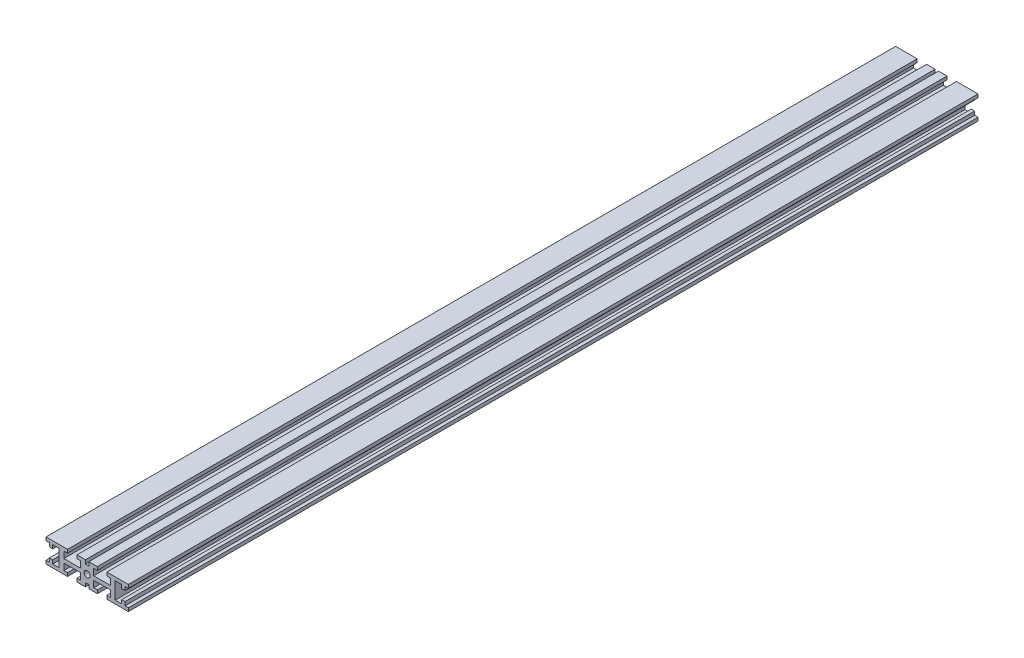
ISO-10303-21;
HEADER;
FILE_DESCRIPTION(('STEP AP214'),'2;1');
FILE_NAME('part.step','',(''),(''),'','','');
FILE_SCHEMA(('AUTOMOTIVE_DESIGN { 1 0 10303 214 1 1 1 1 }'));
ENDSEC;
DATA;
#1=APPLICATION_CONTEXT('core data for automotive mechanical design processes');
#2=APPLICATION_PROTOCOL_DEFINITION('international standard','automotive_design',2000,#1);
#3=PRODUCT_CONTEXT('',#1,'mechanical');
#4=PRODUCT('Part','Part','',(#3));
#5=PRODUCT_RELATED_PRODUCT_CATEGORY('part','',(#4));
#6=PRODUCT_DEFINITION_FORMATION('','',#4);
#7=PRODUCT_DEFINITION_CONTEXT('part definition',#1,'design');
#8=PRODUCT_DEFINITION('design','',#6,#7);
#9=PRODUCT_DEFINITION_SHAPE('','',#8);
#10=(LENGTH_UNIT() NAMED_UNIT(*) SI_UNIT(.MILLI.,.METRE.));
#11=(NAMED_UNIT(*) PLANE_ANGLE_UNIT() SI_UNIT($,.RADIAN.));
#12=(NAMED_UNIT(*) SI_UNIT($,.STERADIAN.) SOLID_ANGLE_UNIT());
#13=UNCERTAINTY_MEASURE_WITH_UNIT(LENGTH_MEASURE(1.E-05),#10,'distance_accuracy_value','');
#14=(GEOMETRIC_REPRESENTATION_CONTEXT(3) GLOBAL_UNCERTAINTY_ASSIGNED_CONTEXT((#13)) GLOBAL_UNIT_ASSIGNED_CONTEXT((#10,
#11,#12)) REPRESENTATION_CONTEXT('',''));
#15=CARTESIAN_POINT('',(0.,0.,0.));
#16=DIRECTION('',(0.,0.,1.));
#17=DIRECTION('',(1.,0.,0.));
#18=AXIS2_PLACEMENT_3D('',#15,#16,#17);
#19=CARTESIAN_POINT('',(5.5,6.35,458.6));
#20=DIRECTION('',(0.,-1.,0.));
#21=DIRECTION('',(0.,0.,-1.));
#22=AXIS2_PLACEMENT_3D('',#19,#20,#21);
#23=PLANE('',#22);
#24=DIRECTION('',(-1.,0.,0.));
#25=VECTOR('',#24,1.);
#26=CARTESIAN_POINT('',(5.5,6.35,0.));
#27=LINE('',#26,#25);
#28=CARTESIAN_POINT('',(5.5,6.35,0.));
#29=VERTEX_POINT('',#28);
#30=CARTESIAN_POINT('',(0.9,6.35,0.));
#31=VERTEX_POINT('',#30);
#32=EDGE_CURVE('E479',#29,#31,#27,.T.);
#33=ORIENTED_EDGE('',*,*,#32,.T.);
#34=DIRECTION('',(0.,0.,1.));
#35=VECTOR('',#34,1.);
#36=CARTESIAN_POINT('',(0.9,6.35,0.));
#37=LINE('',#36,#35);
#38=CARTESIAN_POINT('',(0.9,6.35,458.6));
#39=VERTEX_POINT('',#38);
#40=EDGE_CURVE('E460',#31,#39,#37,.T.);
#41=ORIENTED_EDGE('',*,*,#40,.T.);
#42=DIRECTION('',(-1.,0.,0.));
#43=VECTOR('',#42,1.);
#44=CARTESIAN_POINT('',(5.5,6.35,458.6));
#45=LINE('',#44,#43);
#46=CARTESIAN_POINT('',(5.5,6.35,458.6));
#47=VERTEX_POINT('',#46);
#48=EDGE_CURVE('E821',#47,#39,#45,.T.);
#49=ORIENTED_EDGE('',*,*,#48,.F.);
#50=DIRECTION('',(0.,0.,-1.));
#51=VECTOR('',#50,1.);
#52=CARTESIAN_POINT('',(5.5,6.35,458.6));
#53=LINE('',#52,#51);
#54=EDGE_CURVE('E485',#47,#29,#53,.T.);
#55=ORIENTED_EDGE('',*,*,#54,.T.);
#56=EDGE_LOOP('',(#33,#41,#49,#55));
#57=FACE_BOUND('',#56,.T.);
#58=ADVANCED_FACE('F35',(#57),#23,.F.);
#59=CARTESIAN_POINT('',(-5.5,-6.35,458.6));
#60=DIRECTION('',(0.,1.,0.));
#61=DIRECTION('',(-1.,0.,0.));
#62=AXIS2_PLACEMENT_3D('',#59,#60,#61);
#63=PLANE('',#62);
#64=DIRECTION('',(1.,0.,0.));
#65=VECTOR('',#64,1.);
#66=CARTESIAN_POINT('',(-5.5,-6.35,0.));
#67=LINE('',#66,#65);
#68=CARTESIAN_POINT('',(-5.5,-6.35,0.));
#69=VERTEX_POINT('',#68);
#70=CARTESIAN_POINT('',(-0.899999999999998,-6.35,0.));
#71=VERTEX_POINT('',#70);
#72=EDGE_CURVE('E737',#69,#71,#67,.T.);
#73=ORIENTED_EDGE('',*,*,#72,.T.);
#74=DIRECTION('',(0.,0.,1.));
#75=VECTOR('',#74,1.);
#76=CARTESIAN_POINT('',(-0.899999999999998,-6.35,0.));
#77=LINE('',#76,#75);
#78=CARTESIAN_POINT('',(-0.899999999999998,-6.35,458.6));
#79=VERTEX_POINT('',#78);
#80=EDGE_CURVE('E1083',#71,#79,#77,.T.);
#81=ORIENTED_EDGE('',*,*,#80,.T.);
#82=DIRECTION('',(1.,0.,0.));
#83=VECTOR('',#82,1.);
#84=CARTESIAN_POINT('',(-5.5,-6.35,458.6));
#85=LINE('',#84,#83);
#86=CARTESIAN_POINT('',(-5.5,-6.35,458.6));
#87=VERTEX_POINT('',#86);
#88=EDGE_CURVE('E892',#87,#79,#85,.T.);
#89=ORIENTED_EDGE('',*,*,#88,.F.);
#90=DIRECTION('',(0.,0.,-1.));
#91=VECTOR('',#90,1.);
#92=CARTESIAN_POINT('',(-5.5,-6.35,458.6));
#93=LINE('',#92,#91);
#94=EDGE_CURVE('E680',#87,#69,#93,.T.);
#95=ORIENTED_EDGE('',*,*,#94,.T.);
#96=EDGE_LOOP('',(#73,#81,#89,#95));
#97=FACE_BOUND('',#96,.T.);
#98=ADVANCED_FACE('F1142',(#97),#63,.F.);
#99=CARTESIAN_POINT('',(0.,0.,458.6));
#100=DIRECTION('',(0.,0.,-1.));
#101=DIRECTION('',(-1.,0.,0.));
#102=AXIS2_PLACEMENT_3D('',#99,#100,#101);
#103=PLANE('',#102);
#104=ORIENTED_EDGE('',*,*,#48,.T.);
#105=DIRECTION('',(0.,1.,0.));
#106=VECTOR('',#105,1.);
#107=CARTESIAN_POINT('',(0.9,6.35,458.6));
#108=LINE('',#107,#106);
#109=CARTESIAN_POINT('',(0.9,4.35,458.6));
#110=VERTEX_POINT('',#109);
#111=EDGE_CURVE('E466',#110,#39,#108,.T.);
#112=ORIENTED_EDGE('',*,*,#111,.F.);
#113=DIRECTION('',(1.,0.,0.));
#114=VECTOR('',#113,1.);
#115=CARTESIAN_POINT('',(0.9,4.35,458.6));
#116=LINE('',#115,#114);
#117=CARTESIAN_POINT('',(-0.9,4.35,458.6));
#118=VERTEX_POINT('',#117);
#119=EDGE_CURVE('E481',#118,#110,#116,.T.);
#120=ORIENTED_EDGE('',*,*,#119,.F.);
#121=DIRECTION('',(0.,-1.,0.));
#122=VECTOR('',#121,1.);
#123=CARTESIAN_POINT('',(-0.9,6.35,458.6));
#124=LINE('',#123,#122);
#125=CARTESIAN_POINT('',(-0.9,6.35,458.6));
#126=VERTEX_POINT('',#125);
#127=EDGE_CURVE('E1109',#126,#118,#124,.T.);
#128=ORIENTED_EDGE('',*,*,#127,.F.);
#129=CARTESIAN_POINT('',(-5.5,6.35,458.6));
#130=VERTEX_POINT('',#129);
#131=EDGE_CURVE('E815',#126,#130,#45,.T.);
#132=ORIENTED_EDGE('',*,*,#131,.T.);
#133=DIRECTION('',(0.,-1.,0.));
#134=VECTOR('',#133,1.);
#135=CARTESIAN_POINT('',(-5.5,4.54999999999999,458.6));
#136=LINE('',#135,#134);
#137=CARTESIAN_POINT('',(-5.5,4.54999999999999,458.6));
#138=VERTEX_POINT('',#137);
#139=EDGE_CURVE('E823',#130,#138,#136,.T.);
#140=ORIENTED_EDGE('',*,*,#139,.T.);
#141=DIRECTION('',(1.,0.,0.));
#142=VECTOR('',#141,1.);
#143=CARTESIAN_POINT('',(-3.5,4.54999999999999,458.6));
#144=LINE('',#143,#142);
#145=CARTESIAN_POINT('',(-3.5,4.54999999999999,458.6));
#146=VERTEX_POINT('',#145);
#147=EDGE_CURVE('E825',#138,#146,#144,.T.);
#148=ORIENTED_EDGE('',*,*,#147,.T.);
#149=DIRECTION('',(0.,-1.,0.));
#150=VECTOR('',#149,1.);
#151=CARTESIAN_POINT('',(-3.5,4.54999999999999,458.6));
#152=LINE('',#151,#150);
#153=CARTESIAN_POINT('',(-3.5,1.04999999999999,458.6));
#154=VERTEX_POINT('',#153);
#155=EDGE_CURVE('E827',#146,#154,#152,.T.);
#156=ORIENTED_EDGE('',*,*,#155,.T.);
#157=DIRECTION('',(-1.,0.,0.));
#158=VECTOR('',#157,1.);
#159=CARTESIAN_POINT('',(-3.5,1.04999999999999,458.6));
#160=LINE('',#159,#158);
#161=CARTESIAN_POINT('',(-12.6,1.04999999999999,458.6));
#162=VERTEX_POINT('',#161);
#163=EDGE_CURVE('E829',#154,#162,#160,.T.);
#164=ORIENTED_EDGE('',*,*,#163,.T.);
#165=DIRECTION('',(0.,1.,0.));
#166=VECTOR('',#165,1.);
#167=CARTESIAN_POINT('',(-12.6,1.04999999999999,458.6));
#168=LINE('',#167,#166);
#169=CARTESIAN_POINT('',(-12.6,4.55,458.6));
#170=VERTEX_POINT('',#169);
#171=EDGE_CURVE('E831',#162,#170,#168,.T.);
#172=ORIENTED_EDGE('',*,*,#171,.T.);
#173=DIRECTION('',(1.,0.,0.));
#174=VECTOR('',#173,1.);
#175=CARTESIAN_POINT('',(-12.6,4.55,458.6));
#176=LINE('',#175,#174);
#177=CARTESIAN_POINT('',(-10.6,4.55,458.6));
#178=VERTEX_POINT('',#177);
#179=EDGE_CURVE('E833',#170,#178,#176,.T.);
#180=ORIENTED_EDGE('',*,*,#179,.T.);
#181=DIRECTION('',(0.,1.,0.));
#182=VECTOR('',#181,1.);
#183=CARTESIAN_POINT('',(-10.6,4.55,458.6));
#184=LINE('',#183,#182);
#185=CARTESIAN_POINT('',(-10.6,6.35,458.6));
#186=VERTEX_POINT('',#185);
#187=EDGE_CURVE('E835',#178,#186,#184,.T.);
#188=ORIENTED_EDGE('',*,*,#187,.T.);
#189=DIRECTION('',(-1.,0.,0.));
#190=VECTOR('',#189,1.);
#191=CARTESIAN_POINT('',(-10.6,6.35,458.6));
#192=LINE('',#191,#190);
#193=CARTESIAN_POINT('',(-22.225,6.35,458.6));
#194=VERTEX_POINT('',#193);
#195=EDGE_CURVE('E837',#186,#194,#192,.T.);
#196=ORIENTED_EDGE('',*,*,#195,.T.);
#197=DIRECTION('',(0.,-1.,0.));
#198=VECTOR('',#197,1.);
#199=CARTESIAN_POINT('',(-22.225,6.35,458.6));
#200=LINE('',#199,#198);
#201=CARTESIAN_POINT('',(-22.225,4.55,458.6));
#202=VERTEX_POINT('',#201);
#203=EDGE_CURVE('E839',#194,#202,#200,.T.);
#204=ORIENTED_EDGE('',*,*,#203,.T.);
#205=DIRECTION('',(1.,0.,0.));
#206=VECTOR('',#205,1.);
#207=CARTESIAN_POINT('',(-20.425,4.55,458.6));
#208=LINE('',#207,#206);
#209=CARTESIAN_POINT('',(-20.425,4.55,458.6));
#210=VERTEX_POINT('',#209);
#211=EDGE_CURVE('E841',#202,#210,#208,.T.);
#212=ORIENTED_EDGE('',*,*,#211,.T.);
#213=DIRECTION('',(0.,-1.,0.));
#214=VECTOR('',#213,1.);
#215=CARTESIAN_POINT('',(-20.425,2.55,458.6));
#216=LINE('',#215,#214);
#217=CARTESIAN_POINT('',(-20.425,2.55,458.6));
#218=VERTEX_POINT('',#217);
#219=EDGE_CURVE('E843',#210,#218,#216,.T.);
#220=ORIENTED_EDGE('',*,*,#219,.T.);
#221=DIRECTION('',(1.,0.,0.));
#222=VECTOR('',#221,1.);
#223=CARTESIAN_POINT('',(-18.625,2.55,458.6));
#224=LINE('',#223,#222);
#225=CARTESIAN_POINT('',(-18.625,2.55,458.6));
#226=VERTEX_POINT('',#225);
#227=EDGE_CURVE('E845',#218,#226,#224,.T.);
#228=ORIENTED_EDGE('',*,*,#227,.T.);
#229=DIRECTION('',(0.,1.,0.));
#230=VECTOR('',#229,1.);
#231=CARTESIAN_POINT('',(-18.625,4.55,458.6));
#232=LINE('',#231,#230);
#233=CARTESIAN_POINT('',(-18.625,4.55,458.6));
#234=VERTEX_POINT('',#233);
#235=EDGE_CURVE('E847',#226,#234,#232,.T.);
#236=ORIENTED_EDGE('',*,*,#235,.T.);
#237=DIRECTION('',(1.,0.,0.));
#238=VECTOR('',#237,1.);
#239=CARTESIAN_POINT('',(-15.125,4.55,458.6));
#240=LINE('',#239,#238);
#241=CARTESIAN_POINT('',(-15.125,4.55,458.6));
#242=VERTEX_POINT('',#241);
#243=EDGE_CURVE('E849',#234,#242,#240,.T.);
#244=ORIENTED_EDGE('',*,*,#243,.T.);
#245=DIRECTION('',(0.,-1.,0.));
#246=VECTOR('',#245,1.);
#247=CARTESIAN_POINT('',(-15.125,4.55,458.6));
#248=LINE('',#247,#246);
#249=CARTESIAN_POINT('',(-15.125,-4.55,458.6));
#250=VERTEX_POINT('',#249);
#251=EDGE_CURVE('E851',#242,#250,#248,.T.);
#252=ORIENTED_EDGE('',*,*,#251,.T.);
#253=DIRECTION('',(-1.,0.,0.));
#254=VECTOR('',#253,1.);
#255=CARTESIAN_POINT('',(-18.625,-4.55,458.6));
#256=LINE('',#255,#254);
#257=CARTESIAN_POINT('',(-18.625,-4.55,458.6));
#258=VERTEX_POINT('',#257);
#259=EDGE_CURVE('E853',#250,#258,#256,.T.);
#260=ORIENTED_EDGE('',*,*,#259,.T.);
#261=DIRECTION('',(0.,1.,0.));
#262=VECTOR('',#261,1.);
#263=CARTESIAN_POINT('',(-18.625,-4.55,458.6));
#264=LINE('',#263,#262);
#265=CARTESIAN_POINT('',(-18.625,-2.55,458.6));
#266=VERTEX_POINT('',#265);
#267=EDGE_CURVE('E855',#258,#266,#264,.T.);
#268=ORIENTED_EDGE('',*,*,#267,.T.);
#269=DIRECTION('',(-1.,0.,0.));
#270=VECTOR('',#269,1.);
#271=CARTESIAN_POINT('',(-18.625,-2.55,458.6));
#272=LINE('',#271,#270);
#273=CARTESIAN_POINT('',(-20.425,-2.55,458.6));
#274=VERTEX_POINT('',#273);
#275=EDGE_CURVE('E857',#266,#274,#272,.T.);
#276=ORIENTED_EDGE('',*,*,#275,.T.);
#277=DIRECTION('',(0.,-1.,0.));
#278=VECTOR('',#277,1.);
#279=CARTESIAN_POINT('',(-20.425,-2.55,458.6));
#280=LINE('',#279,#278);
#281=CARTESIAN_POINT('',(-20.425,-4.55,458.6));
#282=VERTEX_POINT('',#281);
#283=EDGE_CURVE('E535',#274,#282,#280,.T.);
#284=ORIENTED_EDGE('',*,*,#283,.T.);
#285=DIRECTION('',(-1.,0.,0.));
#286=VECTOR('',#285,1.);
#287=CARTESIAN_POINT('',(-20.425,-4.55,458.6));
#288=LINE('',#287,#286);
#289=CARTESIAN_POINT('',(-22.225,-4.55,458.6));
#290=VERTEX_POINT('',#289);
#291=EDGE_CURVE('E530',#282,#290,#288,.T.);
#292=ORIENTED_EDGE('',*,*,#291,.T.);
#293=DIRECTION('',(0.,-1.,0.));
#294=VECTOR('',#293,1.);
#295=CARTESIAN_POINT('',(-22.225,-6.35,458.6));
#296=LINE('',#295,#294);
#297=CARTESIAN_POINT('',(-22.225,-6.35,458.6));
#298=VERTEX_POINT('',#297);
#299=EDGE_CURVE('E874',#290,#298,#296,.T.);
#300=ORIENTED_EDGE('',*,*,#299,.T.);
#301=DIRECTION('',(1.,0.,0.));
#302=VECTOR('',#301,1.);
#303=CARTESIAN_POINT('',(-22.225,-6.35,458.6));
#304=LINE('',#303,#302);
#305=CARTESIAN_POINT('',(-10.6,-6.35,458.6));
#306=VERTEX_POINT('',#305);
#307=EDGE_CURVE('E711',#298,#306,#304,.T.);
#308=ORIENTED_EDGE('',*,*,#307,.T.);
#309=DIRECTION('',(0.,1.,0.));
#310=VECTOR('',#309,1.);
#311=CARTESIAN_POINT('',(-10.6,-4.55,458.6));
#312=LINE('',#311,#310);
#313=CARTESIAN_POINT('',(-10.6,-4.55,458.6));
#314=VERTEX_POINT('',#313);
#315=EDGE_CURVE('E877',#306,#314,#312,.T.);
#316=ORIENTED_EDGE('',*,*,#315,.T.);
#317=DIRECTION('',(-1.,0.,0.));
#318=VECTOR('',#317,1.);
#319=CARTESIAN_POINT('',(-12.6,-4.55,458.6));
#320=LINE('',#319,#318);
#321=CARTESIAN_POINT('',(-12.6,-4.55,458.6));
#322=VERTEX_POINT('',#321);
#323=EDGE_CURVE('E879',#314,#322,#320,.T.);
#324=ORIENTED_EDGE('',*,*,#323,.T.);
#325=DIRECTION('',(0.,1.,0.));
#326=VECTOR('',#325,1.);
#327=CARTESIAN_POINT('',(-12.6,-1.05,458.6));
#328=LINE('',#327,#326);
#329=CARTESIAN_POINT('',(-12.6,-1.05,458.6));
#330=VERTEX_POINT('',#329);
#331=EDGE_CURVE('E881',#322,#330,#328,.T.);
#332=ORIENTED_EDGE('',*,*,#331,.T.);
#333=DIRECTION('',(1.,0.,0.));
#334=VECTOR('',#333,1.);
#335=CARTESIAN_POINT('',(-3.5,-1.05,458.6));
#336=LINE('',#335,#334);
#337=CARTESIAN_POINT('',(-3.5,-1.05,458.6));
#338=VERTEX_POINT('',#337);
#339=EDGE_CURVE('E883',#330,#338,#336,.T.);
#340=ORIENTED_EDGE('',*,*,#339,.T.);
#341=DIRECTION('',(0.,-1.,0.));
#342=VECTOR('',#341,1.);
#343=CARTESIAN_POINT('',(-3.5,-4.55,458.6));
#344=LINE('',#343,#342);
#345=CARTESIAN_POINT('',(-3.5,-4.55,458.6));
#346=VERTEX_POINT('',#345);
#347=EDGE_CURVE('E885',#338,#346,#344,.T.);
#348=ORIENTED_EDGE('',*,*,#347,.T.);
#349=DIRECTION('',(-1.,0.,0.));
#350=VECTOR('',#349,1.);
#351=CARTESIAN_POINT('',(-5.5,-4.55,458.6));
#352=LINE('',#351,#350);
#353=CARTESIAN_POINT('',(-5.5,-4.55,458.6));
#354=VERTEX_POINT('',#353);
#355=EDGE_CURVE('E887',#346,#354,#352,.T.);
#356=ORIENTED_EDGE('',*,*,#355,.T.);
#357=DIRECTION('',(0.,-1.,0.));
#358=VECTOR('',#357,1.);
#359=CARTESIAN_POINT('',(-5.5,-4.55,458.6));
#360=LINE('',#359,#358);
#361=EDGE_CURVE('E889',#354,#87,#360,.T.);
#362=ORIENTED_EDGE('',*,*,#361,.T.);
#363=ORIENTED_EDGE('',*,*,#88,.T.);
#364=DIRECTION('',(0.,-1.,0.));
#365=VECTOR('',#364,1.);
#366=CARTESIAN_POINT('',(-0.899999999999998,-6.35,458.6));
#367=LINE('',#366,#365);
#368=CARTESIAN_POINT('',(-0.899999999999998,-4.35,458.6));
#369=VERTEX_POINT('',#368);
#370=EDGE_CURVE('E1096',#369,#79,#367,.T.);
#371=ORIENTED_EDGE('',*,*,#370,.F.);
#372=DIRECTION('',(-1.,0.,0.));
#373=VECTOR('',#372,1.);
#374=CARTESIAN_POINT('',(-0.899999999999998,-4.35,458.6));
#375=LINE('',#374,#373);
#376=CARTESIAN_POINT('',(0.900000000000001,-4.35,458.6));
#377=VERTEX_POINT('',#376);
#378=EDGE_CURVE('E1090',#377,#369,#375,.T.);
#379=ORIENTED_EDGE('',*,*,#378,.F.);
#380=DIRECTION('',(0.,1.,0.));
#381=VECTOR('',#380,1.);
#382=CARTESIAN_POINT('',(0.900000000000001,-6.35,458.6));
#383=LINE('',#382,#381);
#384=CARTESIAN_POINT('',(0.900000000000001,-6.35,458.6));
#385=VERTEX_POINT('',#384);
#386=EDGE_CURVE('E1094',#385,#377,#383,.T.);
#387=ORIENTED_EDGE('',*,*,#386,.F.);
#388=CARTESIAN_POINT('',(5.5,-6.35,458.6));
#389=VERTEX_POINT('',#388);
#390=EDGE_CURVE('E891',#385,#389,#85,.T.);
#391=ORIENTED_EDGE('',*,*,#390,.T.);
#392=DIRECTION('',(0.,1.,0.));
#393=VECTOR('',#392,1.);
#394=CARTESIAN_POINT('',(5.5,-4.55,458.6));
#395=LINE('',#394,#393);
#396=CARTESIAN_POINT('',(5.5,-4.55,458.6));
#397=VERTEX_POINT('',#396);
#398=EDGE_CURVE('E895',#389,#397,#395,.T.);
#399=ORIENTED_EDGE('',*,*,#398,.T.);
#400=DIRECTION('',(-1.,0.,0.));
#401=VECTOR('',#400,1.);
#402=CARTESIAN_POINT('',(5.5,-4.55,458.6));
#403=LINE('',#402,#401);
#404=CARTESIAN_POINT('',(3.5,-4.55,458.6));
#405=VERTEX_POINT('',#404);
#406=EDGE_CURVE('E897',#397,#405,#403,.T.);
#407=ORIENTED_EDGE('',*,*,#406,.T.);
#408=DIRECTION('',(0.,1.,0.));
#409=VECTOR('',#408,1.);
#410=CARTESIAN_POINT('',(3.5,-4.55,458.6));
#411=LINE('',#410,#409);
#412=CARTESIAN_POINT('',(3.5,-1.05,458.6));
#413=VERTEX_POINT('',#412);
#414=EDGE_CURVE('E899',#405,#413,#411,.T.);
#415=ORIENTED_EDGE('',*,*,#414,.T.);
#416=DIRECTION('',(1.,0.,0.));
#417=VECTOR('',#416,1.);
#418=CARTESIAN_POINT('',(3.5,-1.05,458.6));
#419=LINE('',#418,#417);
#420=CARTESIAN_POINT('',(12.6,-1.05,458.6));
#421=VERTEX_POINT('',#420);
#422=EDGE_CURVE('E901',#413,#421,#419,.T.);
#423=ORIENTED_EDGE('',*,*,#422,.T.);
#424=DIRECTION('',(0.,-1.,0.));
#425=VECTOR('',#424,1.);
#426=CARTESIAN_POINT('',(12.6,-1.05,458.6));
#427=LINE('',#426,#425);
#428=CARTESIAN_POINT('',(12.6,-4.55,458.6));
#429=VERTEX_POINT('',#428);
#430=EDGE_CURVE('E903',#421,#429,#427,.T.);
#431=ORIENTED_EDGE('',*,*,#430,.T.);
#432=DIRECTION('',(-1.,0.,0.));
#433=VECTOR('',#432,1.);
#434=CARTESIAN_POINT('',(12.6,-4.55,458.6));
#435=LINE('',#434,#433);
#436=CARTESIAN_POINT('',(10.6,-4.55,458.6));
#437=VERTEX_POINT('',#436);
#438=EDGE_CURVE('E905',#429,#437,#435,.T.);
#439=ORIENTED_EDGE('',*,*,#438,.T.);
#440=DIRECTION('',(0.,-1.,0.));
#441=VECTOR('',#440,1.);
#442=CARTESIAN_POINT('',(10.6,-4.55,458.6));
#443=LINE('',#442,#441);
#444=CARTESIAN_POINT('',(10.6,-6.35,458.6));
#445=VERTEX_POINT('',#444);
#446=EDGE_CURVE('E907',#437,#445,#443,.T.);
#447=ORIENTED_EDGE('',*,*,#446,.T.);
#448=DIRECTION('',(1.,0.,0.));
#449=VECTOR('',#448,1.);
#450=CARTESIAN_POINT('',(22.225,-6.35,458.6));
#451=LINE('',#450,#449);
#452=CARTESIAN_POINT('',(22.225,-6.35,458.6));
#453=VERTEX_POINT('',#452);
#454=EDGE_CURVE('E909',#445,#453,#451,.T.);
#455=ORIENTED_EDGE('',*,*,#454,.T.);
#456=DIRECTION('',(0.,1.,0.));
#457=VECTOR('',#456,1.);
#458=CARTESIAN_POINT('',(22.225,-4.55,458.6));
#459=LINE('',#458,#457);
#460=CARTESIAN_POINT('',(22.225,-4.55,458.6));
#461=VERTEX_POINT('',#460);
#462=EDGE_CURVE('E911',#453,#461,#459,.T.);
#463=ORIENTED_EDGE('',*,*,#462,.T.);
#464=DIRECTION('',(-1.,0.,0.));
#465=VECTOR('',#464,1.);
#466=CARTESIAN_POINT('',(20.425,-4.55,458.6));
#467=LINE('',#466,#465);
#468=CARTESIAN_POINT('',(20.425,-4.55,458.6));
#469=VERTEX_POINT('',#468);
#470=EDGE_CURVE('E913',#461,#469,#467,.T.);
#471=ORIENTED_EDGE('',*,*,#470,.T.);
#472=DIRECTION('',(0.,1.,0.));
#473=VECTOR('',#472,1.);
#474=CARTESIAN_POINT('',(20.425,-2.55,458.6));
#475=LINE('',#474,#473);
#476=CARTESIAN_POINT('',(20.425,-2.55,458.6));
#477=VERTEX_POINT('',#476);
#478=EDGE_CURVE('E915',#469,#477,#475,.T.);
#479=ORIENTED_EDGE('',*,*,#478,.T.);
#480=DIRECTION('',(-1.,0.,0.));
#481=VECTOR('',#480,1.);
#482=CARTESIAN_POINT('',(18.625,-2.55,458.6));
#483=LINE('',#482,#481);
#484=CARTESIAN_POINT('',(18.625,-2.55,458.6));
#485=VERTEX_POINT('',#484);
#486=EDGE_CURVE('E917',#477,#485,#483,.T.);
#487=ORIENTED_EDGE('',*,*,#486,.T.);
#488=DIRECTION('',(0.,-1.,0.));
#489=VECTOR('',#488,1.);
#490=CARTESIAN_POINT('',(18.625,-4.55,458.6));
#491=LINE('',#490,#489);
#492=CARTESIAN_POINT('',(18.625,-4.55,458.6));
#493=VERTEX_POINT('',#492);
#494=EDGE_CURVE('E919',#485,#493,#491,.T.);
#495=ORIENTED_EDGE('',*,*,#494,.T.);
#496=DIRECTION('',(-1.,0.,0.));
#497=VECTOR('',#496,1.);
#498=CARTESIAN_POINT('',(18.625,-4.55,458.6));
#499=LINE('',#498,#497);
#500=CARTESIAN_POINT('',(15.125,-4.55,458.6));
#501=VERTEX_POINT('',#500);
#502=EDGE_CURVE('E921',#493,#501,#499,.T.);
#503=ORIENTED_EDGE('',*,*,#502,.T.);
#504=DIRECTION('',(0.,1.,0.));
#505=VECTOR('',#504,1.);
#506=CARTESIAN_POINT('',(15.125,4.55,458.6));
#507=LINE('',#506,#505);
#508=CARTESIAN_POINT('',(15.125,4.55,458.6));
#509=VERTEX_POINT('',#508);
#510=EDGE_CURVE('E923',#501,#509,#507,.T.);
#511=ORIENTED_EDGE('',*,*,#510,.T.);
#512=DIRECTION('',(1.,0.,0.));
#513=VECTOR('',#512,1.);
#514=CARTESIAN_POINT('',(15.125,4.55,458.6));
#515=LINE('',#514,#513);
#516=CARTESIAN_POINT('',(18.625,4.55,458.6));
#517=VERTEX_POINT('',#516);
#518=EDGE_CURVE('E925',#509,#517,#515,.T.);
#519=ORIENTED_EDGE('',*,*,#518,.T.);
#520=DIRECTION('',(0.,-1.,0.));
#521=VECTOR('',#520,1.);
#522=CARTESIAN_POINT('',(18.625,4.55,458.6));
#523=LINE('',#522,#521);
#524=CARTESIAN_POINT('',(18.625,2.55,458.6));
#525=VERTEX_POINT('',#524);
#526=EDGE_CURVE('E927',#517,#525,#523,.T.);
#527=ORIENTED_EDGE('',*,*,#526,.T.);
#528=DIRECTION('',(1.,0.,0.));
#529=VECTOR('',#528,1.);
#530=CARTESIAN_POINT('',(18.625,2.55,458.6));
#531=LINE('',#530,#529);
#532=CARTESIAN_POINT('',(20.425,2.55,458.6));
#533=VERTEX_POINT('',#532);
#534=EDGE_CURVE('E929',#525,#533,#531,.T.);
#535=ORIENTED_EDGE('',*,*,#534,.T.);
#536=DIRECTION('',(0.,1.,0.));
#537=VECTOR('',#536,1.);
#538=CARTESIAN_POINT('',(20.425,2.55,458.6));
#539=LINE('',#538,#537);
#540=CARTESIAN_POINT('',(20.425,4.55,458.6));
#541=VERTEX_POINT('',#540);
#542=EDGE_CURVE('E931',#533,#541,#539,.T.);
#543=ORIENTED_EDGE('',*,*,#542,.T.);
#544=DIRECTION('',(1.,0.,0.));
#545=VECTOR('',#544,1.);
#546=CARTESIAN_POINT('',(20.425,4.55,458.6));
#547=LINE('',#546,#545);
#548=CARTESIAN_POINT('',(22.225,4.55,458.6));
#549=VERTEX_POINT('',#548);
#550=EDGE_CURVE('E933',#541,#549,#547,.T.);
#551=ORIENTED_EDGE('',*,*,#550,.T.);
#552=DIRECTION('',(0.,1.,0.));
#553=VECTOR('',#552,1.);
#554=CARTESIAN_POINT('',(22.225,4.55,458.6));
#555=LINE('',#554,#553);
#556=CARTESIAN_POINT('',(22.225,6.35,458.6));
#557=VERTEX_POINT('',#556);
#558=EDGE_CURVE('E935',#549,#557,#555,.T.);
#559=ORIENTED_EDGE('',*,*,#558,.T.);
#560=DIRECTION('',(-1.,0.,0.));
#561=VECTOR('',#560,1.);
#562=CARTESIAN_POINT('',(10.6,6.35,458.6));
#563=LINE('',#562,#561);
#564=CARTESIAN_POINT('',(10.6,6.35,458.6));
#565=VERTEX_POINT('',#564);
#566=EDGE_CURVE('E937',#557,#565,#563,.T.);
#567=ORIENTED_EDGE('',*,*,#566,.T.);
#568=DIRECTION('',(0.,-1.,0.));
#569=VECTOR('',#568,1.);
#570=CARTESIAN_POINT('',(10.6,4.55,458.6));
#571=LINE('',#570,#569);
#572=CARTESIAN_POINT('',(10.6,4.55,458.6));
#573=VERTEX_POINT('',#572);
#574=EDGE_CURVE('E939',#565,#573,#571,.T.);
#575=ORIENTED_EDGE('',*,*,#574,.T.);
#576=DIRECTION('',(1.,0.,0.));
#577=VECTOR('',#576,1.);
#578=CARTESIAN_POINT('',(12.6,4.55,458.6));
#579=LINE('',#578,#577);
#580=CARTESIAN_POINT('',(12.6,4.55,458.6));
#581=VERTEX_POINT('',#580);
#582=EDGE_CURVE('E941',#573,#581,#579,.T.);
#583=ORIENTED_EDGE('',*,*,#582,.T.);
#584=DIRECTION('',(0.,-1.,0.));
#585=VECTOR('',#584,1.);
#586=CARTESIAN_POINT('',(12.6,1.04999999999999,458.6));
#587=LINE('',#586,#585);
#588=CARTESIAN_POINT('',(12.6,1.04999999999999,458.6));
#589=VERTEX_POINT('',#588);
#590=EDGE_CURVE('E943',#581,#589,#587,.T.);
#591=ORIENTED_EDGE('',*,*,#590,.T.);
#592=DIRECTION('',(-1.,0.,0.));
#593=VECTOR('',#592,1.);
#594=CARTESIAN_POINT('',(3.5,1.04999999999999,458.6));
#595=LINE('',#594,#593);
#596=CARTESIAN_POINT('',(3.5,1.04999999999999,458.6));
#597=VERTEX_POINT('',#596);
#598=EDGE_CURVE('E817',#589,#597,#595,.T.);
#599=ORIENTED_EDGE('',*,*,#598,.T.);
#600=DIRECTION('',(0.,1.,0.));
#601=VECTOR('',#600,1.);
#602=CARTESIAN_POINT('',(3.5,4.54999999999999,458.6));
#603=LINE('',#602,#601);
#604=CARTESIAN_POINT('',(3.5,4.54999999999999,458.6));
#605=VERTEX_POINT('',#604);
#606=EDGE_CURVE('E813',#597,#605,#603,.T.);
#607=ORIENTED_EDGE('',*,*,#606,.T.);
#608=DIRECTION('',(1.,0.,0.));
#609=VECTOR('',#608,1.);
#610=CARTESIAN_POINT('',(3.5,4.54999999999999,458.6));
#611=LINE('',#610,#609);
#612=CARTESIAN_POINT('',(5.5,4.54999999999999,458.6));
#613=VERTEX_POINT('',#612);
#614=EDGE_CURVE('E810',#605,#613,#611,.T.);
#615=ORIENTED_EDGE('',*,*,#614,.T.);
#616=DIRECTION('',(0.,1.,0.));
#617=VECTOR('',#616,1.);
#618=CARTESIAN_POINT('',(5.5,4.54999999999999,458.6));
#619=LINE('',#618,#617);
#620=EDGE_CURVE('E812',#613,#47,#619,.T.);
#621=ORIENTED_EDGE('',*,*,#620,.T.);
#622=EDGE_LOOP('',(#104,#112,#120,#128,#132,#140,#148,#156,#164,#172,#180,#188,#196,#204,#212,
#220,#228,#236,#244,#252,#260,#268,#276,#284,#292,#300,#308,#316,#324,#332,#340,#348,#356,#362,
#363,#371,#379,#387,#391,#399,#407,#415,#423,#431,#439,#447,#455,#463,#471,#479,#487,#495,#503,
#511,#519,#527,#535,#543,#551,#559,#567,#575,#583,#591,#599,#607,#615,#621));
#623=FACE_BOUND('',#622,.T.);
#624=CARTESIAN_POINT('',(0.,0.,458.6));
#625=DIRECTION('',(0.,0.,1.));
#626=DIRECTION('',(1.,0.,0.));
#627=AXIS2_PLACEMENT_3D('',#624,#625,#626);
#628=CIRCLE('',#627,1.64999999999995);
#629=CARTESIAN_POINT('',(1.64999999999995,0.,458.6));
#630=VERTEX_POINT('',#629);
#631=EDGE_CURVE('E864',#630,#630,#628,.T.);
#632=ORIENTED_EDGE('',*,*,#631,.F.);
#633=EDGE_LOOP('',(#632));
#634=FACE_BOUND('',#633,.T.);
#635=ADVANCED_FACE('F945',(#623,#634),#103,.F.);
#636=CARTESIAN_POINT('',(0.,0.,0.));
#637=DIRECTION('',(0.,0.,-1.));
#638=DIRECTION('',(-1.,0.,0.));
#639=AXIS2_PLACEMENT_3D('',#636,#637,#638);
#640=PLANE('',#639);
#641=DIRECTION('',(0.,1.,0.));
#642=VECTOR('',#641,1.);
#643=CARTESIAN_POINT('',(0.9,6.35,0.));
#644=LINE('',#643,#642);
#645=CARTESIAN_POINT('',(0.9,4.35,0.));
#646=VERTEX_POINT('',#645);
#647=EDGE_CURVE('E463',#646,#31,#644,.T.);
#648=ORIENTED_EDGE('',*,*,#647,.T.);
#649=ORIENTED_EDGE('',*,*,#32,.F.);
#650=DIRECTION('',(0.,1.,0.));
#651=VECTOR('',#650,1.);
#652=CARTESIAN_POINT('',(5.5,4.54999999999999,0.));
#653=LINE('',#652,#651);
#654=CARTESIAN_POINT('',(5.5,4.54999999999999,0.));
#655=VERTEX_POINT('',#654);
#656=EDGE_CURVE('E491',#655,#29,#653,.T.);
#657=ORIENTED_EDGE('',*,*,#656,.F.);
#658=DIRECTION('',(1.,0.,0.));
#659=VECTOR('',#658,1.);
#660=CARTESIAN_POINT('',(3.5,4.54999999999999,0.));
#661=LINE('',#660,#659);
#662=CARTESIAN_POINT('',(3.5,4.54999999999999,0.));
#663=VERTEX_POINT('',#662);
#664=EDGE_CURVE('E793',#663,#655,#661,.T.);
#665=ORIENTED_EDGE('',*,*,#664,.F.);
#666=DIRECTION('',(0.,1.,0.));
#667=VECTOR('',#666,1.);
#668=CARTESIAN_POINT('',(3.5,4.54999999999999,0.));
#669=LINE('',#668,#667);
#670=CARTESIAN_POINT('',(3.5,1.04999999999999,0.));
#671=VERTEX_POINT('',#670);
#672=EDGE_CURVE('E792',#671,#663,#669,.T.);
#673=ORIENTED_EDGE('',*,*,#672,.F.);
#674=DIRECTION('',(-1.,0.,0.));
#675=VECTOR('',#674,1.);
#676=CARTESIAN_POINT('',(3.5,1.04999999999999,0.));
#677=LINE('',#676,#675);
#678=CARTESIAN_POINT('',(12.6,1.04999999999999,0.));
#679=VERTEX_POINT('',#678);
#680=EDGE_CURVE('E790',#679,#671,#677,.T.);
#681=ORIENTED_EDGE('',*,*,#680,.F.);
#682=DIRECTION('',(0.,-1.,0.));
#683=VECTOR('',#682,1.);
#684=CARTESIAN_POINT('',(12.6,1.04999999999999,0.));
#685=LINE('',#684,#683);
#686=CARTESIAN_POINT('',(12.6,4.55,0.));
#687=VERTEX_POINT('',#686);
#688=EDGE_CURVE('E788',#687,#679,#685,.T.);
#689=ORIENTED_EDGE('',*,*,#688,.F.);
#690=DIRECTION('',(1.,0.,0.));
#691=VECTOR('',#690,1.);
#692=CARTESIAN_POINT('',(12.6,4.55,0.));
#693=LINE('',#692,#691);
#694=CARTESIAN_POINT('',(10.6,4.55,0.));
#695=VERTEX_POINT('',#694);
#696=EDGE_CURVE('E786',#695,#687,#693,.T.);
#697=ORIENTED_EDGE('',*,*,#696,.F.);
#698=DIRECTION('',(0.,-1.,0.));
#699=VECTOR('',#698,1.);
#700=CARTESIAN_POINT('',(10.6,4.55,0.));
#701=LINE('',#700,#699);
#702=CARTESIAN_POINT('',(10.6,6.35,0.));
#703=VERTEX_POINT('',#702);
#704=EDGE_CURVE('E784',#703,#695,#701,.T.);
#705=ORIENTED_EDGE('',*,*,#704,.F.);
#706=DIRECTION('',(-1.,0.,0.));
#707=VECTOR('',#706,1.);
#708=CARTESIAN_POINT('',(10.6,6.35,0.));
#709=LINE('',#708,#707);
#710=CARTESIAN_POINT('',(22.225,6.35,0.));
#711=VERTEX_POINT('',#710);
#712=EDGE_CURVE('E782',#711,#703,#709,.T.);
#713=ORIENTED_EDGE('',*,*,#712,.F.);
#714=DIRECTION('',(0.,1.,0.));
#715=VECTOR('',#714,1.);
#716=CARTESIAN_POINT('',(22.225,4.55,0.));
#717=LINE('',#716,#715);
#718=CARTESIAN_POINT('',(22.225,4.55,0.));
#719=VERTEX_POINT('',#718);
#720=EDGE_CURVE('E780',#719,#711,#717,.T.);
#721=ORIENTED_EDGE('',*,*,#720,.F.);
#722=DIRECTION('',(1.,0.,0.));
#723=VECTOR('',#722,1.);
#724=CARTESIAN_POINT('',(20.425,4.55,0.));
#725=LINE('',#724,#723);
#726=CARTESIAN_POINT('',(20.425,4.55,0.));
#727=VERTEX_POINT('',#726);
#728=EDGE_CURVE('E778',#727,#719,#725,.T.);
#729=ORIENTED_EDGE('',*,*,#728,.F.);
#730=DIRECTION('',(0.,1.,0.));
#731=VECTOR('',#730,1.);
#732=CARTESIAN_POINT('',(20.425,2.55,0.));
#733=LINE('',#732,#731);
#734=CARTESIAN_POINT('',(20.425,2.55,0.));
#735=VERTEX_POINT('',#734);
#736=EDGE_CURVE('E776',#735,#727,#733,.T.);
#737=ORIENTED_EDGE('',*,*,#736,.F.);
#738=DIRECTION('',(1.,0.,0.));
#739=VECTOR('',#738,1.);
#740=CARTESIAN_POINT('',(18.625,2.55,0.));
#741=LINE('',#740,#739);
#742=CARTESIAN_POINT('',(18.625,2.55,0.));
#743=VERTEX_POINT('',#742);
#744=EDGE_CURVE('E774',#743,#735,#741,.T.);
#745=ORIENTED_EDGE('',*,*,#744,.F.);
#746=DIRECTION('',(0.,-1.,0.));
#747=VECTOR('',#746,1.);
#748=CARTESIAN_POINT('',(18.625,4.55,0.));
#749=LINE('',#748,#747);
#750=CARTESIAN_POINT('',(18.625,4.55,0.));
#751=VERTEX_POINT('',#750);
#752=EDGE_CURVE('E772',#751,#743,#749,.T.);
#753=ORIENTED_EDGE('',*,*,#752,.F.);
#754=DIRECTION('',(1.,0.,0.));
#755=VECTOR('',#754,1.);
#756=CARTESIAN_POINT('',(15.125,4.55,0.));
#757=LINE('',#756,#755);
#758=CARTESIAN_POINT('',(15.125,4.55,0.));
#759=VERTEX_POINT('',#758);
#760=EDGE_CURVE('E770',#759,#751,#757,.T.);
#761=ORIENTED_EDGE('',*,*,#760,.F.);
#762=DIRECTION('',(0.,1.,0.));
#763=VECTOR('',#762,1.);
#764=CARTESIAN_POINT('',(15.125,4.55,0.));
#765=LINE('',#764,#763);
#766=CARTESIAN_POINT('',(15.125,-4.55,0.));
#767=VERTEX_POINT('',#766);
#768=EDGE_CURVE('E768',#767,#759,#765,.T.);
#769=ORIENTED_EDGE('',*,*,#768,.F.);
#770=DIRECTION('',(-1.,0.,0.));
#771=VECTOR('',#770,1.);
#772=CARTESIAN_POINT('',(18.625,-4.55,0.));
#773=LINE('',#772,#771);
#774=CARTESIAN_POINT('',(18.625,-4.55,0.));
#775=VERTEX_POINT('',#774);
#776=EDGE_CURVE('E766',#775,#767,#773,.T.);
#777=ORIENTED_EDGE('',*,*,#776,.F.);
#778=DIRECTION('',(0.,-1.,0.));
#779=VECTOR('',#778,1.);
#780=CARTESIAN_POINT('',(18.625,-4.55,0.));
#781=LINE('',#780,#779);
#782=CARTESIAN_POINT('',(18.625,-2.55,0.));
#783=VERTEX_POINT('',#782);
#784=EDGE_CURVE('E764',#783,#775,#781,.T.);
#785=ORIENTED_EDGE('',*,*,#784,.F.);
#786=DIRECTION('',(-1.,0.,0.));
#787=VECTOR('',#786,1.);
#788=CARTESIAN_POINT('',(18.625,-2.55,0.));
#789=LINE('',#788,#787);
#790=CARTESIAN_POINT('',(20.425,-2.55,0.));
#791=VERTEX_POINT('',#790);
#792=EDGE_CURVE('E762',#791,#783,#789,.T.);
#793=ORIENTED_EDGE('',*,*,#792,.F.);
#794=DIRECTION('',(0.,1.,0.));
#795=VECTOR('',#794,1.);
#796=CARTESIAN_POINT('',(20.425,-2.55,0.));
#797=LINE('',#796,#795);
#798=CARTESIAN_POINT('',(20.425,-4.55,0.));
#799=VERTEX_POINT('',#798);
#800=EDGE_CURVE('E760',#799,#791,#797,.T.);
#801=ORIENTED_EDGE('',*,*,#800,.F.);
#802=DIRECTION('',(-1.,0.,0.));
#803=VECTOR('',#802,1.);
#804=CARTESIAN_POINT('',(20.425,-4.55,0.));
#805=LINE('',#804,#803);
#806=CARTESIAN_POINT('',(22.225,-4.55,0.));
#807=VERTEX_POINT('',#806);
#808=EDGE_CURVE('E758',#807,#799,#805,.T.);
#809=ORIENTED_EDGE('',*,*,#808,.F.);
#810=DIRECTION('',(0.,1.,0.));
#811=VECTOR('',#810,1.);
#812=CARTESIAN_POINT('',(22.225,-4.55,0.));
#813=LINE('',#812,#811);
#814=CARTESIAN_POINT('',(22.225,-6.35,0.));
#815=VERTEX_POINT('',#814);
#816=EDGE_CURVE('E756',#815,#807,#813,.T.);
#817=ORIENTED_EDGE('',*,*,#816,.F.);
#818=DIRECTION('',(1.,0.,0.));
#819=VECTOR('',#818,1.);
#820=CARTESIAN_POINT('',(22.225,-6.35,0.));
#821=LINE('',#820,#819);
#822=CARTESIAN_POINT('',(10.6,-6.35,0.));
#823=VERTEX_POINT('',#822);
#824=EDGE_CURVE('E754',#823,#815,#821,.T.);
#825=ORIENTED_EDGE('',*,*,#824,.F.);
#826=DIRECTION('',(0.,-1.,0.));
#827=VECTOR('',#826,1.);
#828=CARTESIAN_POINT('',(10.6,-4.55,0.));
#829=LINE('',#828,#827);
#830=CARTESIAN_POINT('',(10.6,-4.55,0.));
#831=VERTEX_POINT('',#830);
#832=EDGE_CURVE('E752',#831,#823,#829,.T.);
#833=ORIENTED_EDGE('',*,*,#832,.F.);
#834=DIRECTION('',(-1.,0.,0.));
#835=VECTOR('',#834,1.);
#836=CARTESIAN_POINT('',(12.6,-4.55,0.));
#837=LINE('',#836,#835);
#838=CARTESIAN_POINT('',(12.6,-4.55,0.));
#839=VERTEX_POINT('',#838);
#840=EDGE_CURVE('E750',#839,#831,#837,.T.);
#841=ORIENTED_EDGE('',*,*,#840,.F.);
#842=DIRECTION('',(0.,-1.,0.));
#843=VECTOR('',#842,1.);
#844=CARTESIAN_POINT('',(12.6,-1.05,0.));
#845=LINE('',#844,#843);
#846=CARTESIAN_POINT('',(12.6,-1.05,0.));
#847=VERTEX_POINT('',#846);
#848=EDGE_CURVE('E748',#847,#839,#845,.T.);
#849=ORIENTED_EDGE('',*,*,#848,.F.);
#850=DIRECTION('',(1.,0.,0.));
#851=VECTOR('',#850,1.);
#852=CARTESIAN_POINT('',(3.5,-1.05,0.));
#853=LINE('',#852,#851);
#854=CARTESIAN_POINT('',(3.5,-1.05,0.));
#855=VERTEX_POINT('',#854);
#856=EDGE_CURVE('E746',#855,#847,#853,.T.);
#857=ORIENTED_EDGE('',*,*,#856,.F.);
#858=DIRECTION('',(0.,1.,0.));
#859=VECTOR('',#858,1.);
#860=CARTESIAN_POINT('',(3.5,-4.55,0.));
#861=LINE('',#860,#859);
#862=CARTESIAN_POINT('',(3.5,-4.55,0.));
#863=VERTEX_POINT('',#862);
#864=EDGE_CURVE('E744',#863,#855,#861,.T.);
#865=ORIENTED_EDGE('',*,*,#864,.F.);
#866=DIRECTION('',(-1.,0.,0.));
#867=VECTOR('',#866,1.);
#868=CARTESIAN_POINT('',(5.5,-4.55,0.));
#869=LINE('',#868,#867);
#870=CARTESIAN_POINT('',(5.5,-4.55,0.));
#871=VERTEX_POINT('',#870);
#872=EDGE_CURVE('E742',#871,#863,#869,.T.);
#873=ORIENTED_EDGE('',*,*,#872,.F.);
#874=DIRECTION('',(0.,1.,0.));
#875=VECTOR('',#874,1.);
#876=CARTESIAN_POINT('',(5.5,-4.55,0.));
#877=LINE('',#876,#875);
#878=CARTESIAN_POINT('',(5.5,-6.35,0.));
#879=VERTEX_POINT('',#878);
#880=EDGE_CURVE('E740',#879,#871,#877,.T.);
#881=ORIENTED_EDGE('',*,*,#880,.F.);
#882=CARTESIAN_POINT('',(0.900000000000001,-6.35,0.));
#883=VERTEX_POINT('',#882);
#884=EDGE_CURVE('E736',#883,#879,#67,.T.);
#885=ORIENTED_EDGE('',*,*,#884,.F.);
#886=DIRECTION('',(0.,1.,0.));
#887=VECTOR('',#886,1.);
#888=CARTESIAN_POINT('',(0.900000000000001,-6.35,0.));
#889=LINE('',#888,#887);
#890=CARTESIAN_POINT('',(0.900000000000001,-4.35,0.));
#891=VERTEX_POINT('',#890);
#892=EDGE_CURVE('E58',#883,#891,#889,.T.);
#893=ORIENTED_EDGE('',*,*,#892,.T.);
#894=DIRECTION('',(-1.,0.,0.));
#895=VECTOR('',#894,1.);
#896=CARTESIAN_POINT('',(-0.899999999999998,-4.35,0.));
#897=LINE('',#896,#895);
#898=CARTESIAN_POINT('',(-0.899999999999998,-4.35,0.));
#899=VERTEX_POINT('',#898);
#900=EDGE_CURVE('E1087',#891,#899,#897,.T.);
#901=ORIENTED_EDGE('',*,*,#900,.T.);
#902=DIRECTION('',(0.,-1.,0.));
#903=VECTOR('',#902,1.);
#904=CARTESIAN_POINT('',(-0.899999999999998,-6.35,0.));
#905=LINE('',#904,#903);
#906=EDGE_CURVE('E1093',#899,#71,#905,.T.);
#907=ORIENTED_EDGE('',*,*,#906,.T.);
#908=ORIENTED_EDGE('',*,*,#72,.F.);
#909=DIRECTION('',(0.,-1.,0.));
#910=VECTOR('',#909,1.);
#911=CARTESIAN_POINT('',(-5.5,-4.55,0.));
#912=LINE('',#911,#910);
#913=CARTESIAN_POINT('',(-5.5,-4.55,0.));
#914=VERTEX_POINT('',#913);
#915=EDGE_CURVE('E734',#914,#69,#912,.T.);
#916=ORIENTED_EDGE('',*,*,#915,.F.);
#917=DIRECTION('',(-1.,0.,0.));
#918=VECTOR('',#917,1.);
#919=CARTESIAN_POINT('',(-5.5,-4.55,0.));
#920=LINE('',#919,#918);
#921=CARTESIAN_POINT('',(-3.5,-4.55,0.));
#922=VERTEX_POINT('',#921);
#923=EDGE_CURVE('E732',#922,#914,#920,.T.);
#924=ORIENTED_EDGE('',*,*,#923,.F.);
#925=DIRECTION('',(0.,-1.,0.));
#926=VECTOR('',#925,1.);
#927=CARTESIAN_POINT('',(-3.5,-4.55,0.));
#928=LINE('',#927,#926);
#929=CARTESIAN_POINT('',(-3.5,-1.05,0.));
#930=VERTEX_POINT('',#929);
#931=EDGE_CURVE('E730',#930,#922,#928,.T.);
#932=ORIENTED_EDGE('',*,*,#931,.F.);
#933=DIRECTION('',(1.,0.,0.));
#934=VECTOR('',#933,1.);
#935=CARTESIAN_POINT('',(-3.5,-1.05,0.));
#936=LINE('',#935,#934);
#937=CARTESIAN_POINT('',(-12.6,-1.05,0.));
#938=VERTEX_POINT('',#937);
#939=EDGE_CURVE('E728',#938,#930,#936,.T.);
#940=ORIENTED_EDGE('',*,*,#939,.F.);
#941=DIRECTION('',(0.,1.,0.));
#942=VECTOR('',#941,1.);
#943=CARTESIAN_POINT('',(-12.6,-1.05,0.));
#944=LINE('',#943,#942);
#945=CARTESIAN_POINT('',(-12.6,-4.55,0.));
#946=VERTEX_POINT('',#945);
#947=EDGE_CURVE('E726',#946,#938,#944,.T.);
#948=ORIENTED_EDGE('',*,*,#947,.F.);
#949=DIRECTION('',(-1.,0.,0.));
#950=VECTOR('',#949,1.);
#951=CARTESIAN_POINT('',(-12.6,-4.55,0.));
#952=LINE('',#951,#950);
#953=CARTESIAN_POINT('',(-10.6,-4.55,0.));
#954=VERTEX_POINT('',#953);
#955=EDGE_CURVE('E719',#954,#946,#952,.T.);
#956=ORIENTED_EDGE('',*,*,#955,.F.);
#957=DIRECTION('',(0.,1.,0.));
#958=VECTOR('',#957,1.);
#959=CARTESIAN_POINT('',(-10.6,-4.55,0.));
#960=LINE('',#959,#958);
#961=CARTESIAN_POINT('',(-10.6,-6.35,0.));
#962=VERTEX_POINT('',#961);
#963=EDGE_CURVE('E717',#962,#954,#960,.T.);
#964=ORIENTED_EDGE('',*,*,#963,.F.);
#965=DIRECTION('',(1.,0.,0.));
#966=VECTOR('',#965,1.);
#967=CARTESIAN_POINT('',(-22.225,-6.35,0.));
#968=LINE('',#967,#966);
#969=CARTESIAN_POINT('',(-22.225,-6.35,0.));
#970=VERTEX_POINT('',#969);
#971=EDGE_CURVE('E710',#970,#962,#968,.T.);
#972=ORIENTED_EDGE('',*,*,#971,.F.);
#973=DIRECTION('',(0.,-1.,0.));
#974=VECTOR('',#973,1.);
#975=CARTESIAN_POINT('',(-22.225,-6.35,0.));
#976=LINE('',#975,#974);
#977=CARTESIAN_POINT('',(-22.225,-4.55,0.));
#978=VERTEX_POINT('',#977);
#979=EDGE_CURVE('E715',#978,#970,#976,.T.);
#980=ORIENTED_EDGE('',*,*,#979,.F.);
#981=DIRECTION('',(-1.,0.,0.));
#982=VECTOR('',#981,1.);
#983=CARTESIAN_POINT('',(-20.425,-4.55,0.));
#984=LINE('',#983,#982);
#985=CARTESIAN_POINT('',(-20.425,-4.55,0.));
#986=VERTEX_POINT('',#985);
#987=EDGE_CURVE('E721',#986,#978,#984,.T.);
#988=ORIENTED_EDGE('',*,*,#987,.F.);
#989=DIRECTION('',(0.,-1.,0.));
#990=VECTOR('',#989,1.);
#991=CARTESIAN_POINT('',(-20.425,-2.55,0.));
#992=LINE('',#991,#990);
#993=CARTESIAN_POINT('',(-20.425,-2.55,0.));
#994=VERTEX_POINT('',#993);
#995=EDGE_CURVE('E528',#994,#986,#992,.T.);
#996=ORIENTED_EDGE('',*,*,#995,.F.);
#997=DIRECTION('',(-1.,0.,0.));
#998=VECTOR('',#997,1.);
#999=CARTESIAN_POINT('',(-18.625,-2.55,0.));
#1000=LINE('',#999,#998);
#1001=CARTESIAN_POINT('',(-18.625,-2.55,0.));
#1002=VERTEX_POINT('',#1001);
#1003=EDGE_CURVE('E526',#1002,#994,#1000,.T.);
#1004=ORIENTED_EDGE('',*,*,#1003,.F.);
#1005=DIRECTION('',(0.,1.,0.));
#1006=VECTOR('',#1005,1.);
#1007=CARTESIAN_POINT('',(-18.625,-4.55,0.));
#1008=LINE('',#1007,#1006);
#1009=CARTESIAN_POINT('',(-18.625,-4.55,0.));
#1010=VERTEX_POINT('',#1009);
#1011=EDGE_CURVE('E524',#1010,#1002,#1008,.T.);
#1012=ORIENTED_EDGE('',*,*,#1011,.F.);
#1013=DIRECTION('',(-1.,0.,0.));
#1014=VECTOR('',#1013,1.);
#1015=CARTESIAN_POINT('',(-18.625,-4.55,0.));
#1016=LINE('',#1015,#1014);
#1017=CARTESIAN_POINT('',(-15.125,-4.55,0.));
#1018=VERTEX_POINT('',#1017);
#1019=EDGE_CURVE('E522',#1018,#1010,#1016,.T.);
#1020=ORIENTED_EDGE('',*,*,#1019,.F.);
#1021=DIRECTION('',(0.,-1.,0.));
#1022=VECTOR('',#1021,1.);
#1023=CARTESIAN_POINT('',(-15.125,4.55,0.));
#1024=LINE('',#1023,#1022);
#1025=CARTESIAN_POINT('',(-15.125,4.55,0.));
#1026=VERTEX_POINT('',#1025);
#1027=EDGE_CURVE('E520',#1026,#1018,#1024,.T.);
#1028=ORIENTED_EDGE('',*,*,#1027,.F.);
#1029=DIRECTION('',(1.,0.,0.));
#1030=VECTOR('',#1029,1.);
#1031=CARTESIAN_POINT('',(-15.125,4.55,0.));
#1032=LINE('',#1031,#1030);
#1033=CARTESIAN_POINT('',(-18.625,4.55,0.));
#1034=VERTEX_POINT('',#1033);
#1035=EDGE_CURVE('E518',#1034,#1026,#1032,.T.);
#1036=ORIENTED_EDGE('',*,*,#1035,.F.);
#1037=DIRECTION('',(0.,1.,0.));
#1038=VECTOR('',#1037,1.);
#1039=CARTESIAN_POINT('',(-18.625,4.55,0.));
#1040=LINE('',#1039,#1038);
#1041=CARTESIAN_POINT('',(-18.625,2.55,0.));
#1042=VERTEX_POINT('',#1041);
#1043=EDGE_CURVE('E516',#1042,#1034,#1040,.T.);
#1044=ORIENTED_EDGE('',*,*,#1043,.F.);
#1045=DIRECTION('',(1.,0.,0.));
#1046=VECTOR('',#1045,1.);
#1047=CARTESIAN_POINT('',(-18.625,2.55,0.));
#1048=LINE('',#1047,#1046);
#1049=CARTESIAN_POINT('',(-20.425,2.55,0.));
#1050=VERTEX_POINT('',#1049);
#1051=EDGE_CURVE('E514',#1050,#1042,#1048,.T.);
#1052=ORIENTED_EDGE('',*,*,#1051,.F.);
#1053=DIRECTION('',(0.,-1.,0.));
#1054=VECTOR('',#1053,1.);
#1055=CARTESIAN_POINT('',(-20.425,2.55,0.));
#1056=LINE('',#1055,#1054);
#1057=CARTESIAN_POINT('',(-20.425,4.55,0.));
#1058=VERTEX_POINT('',#1057);
#1059=EDGE_CURVE('E512',#1058,#1050,#1056,.T.);
#1060=ORIENTED_EDGE('',*,*,#1059,.F.);
#1061=DIRECTION('',(1.,0.,0.));
#1062=VECTOR('',#1061,1.);
#1063=CARTESIAN_POINT('',(-20.425,4.55,0.));
#1064=LINE('',#1063,#1062);
#1065=CARTESIAN_POINT('',(-22.225,4.55,0.));
#1066=VERTEX_POINT('',#1065);
#1067=EDGE_CURVE('E510',#1066,#1058,#1064,.T.);
#1068=ORIENTED_EDGE('',*,*,#1067,.F.);
#1069=DIRECTION('',(0.,-1.,0.));
#1070=VECTOR('',#1069,1.);
#1071=CARTESIAN_POINT('',(-22.225,6.35,0.));
#1072=LINE('',#1071,#1070);
#1073=CARTESIAN_POINT('',(-22.225,6.35,0.));
#1074=VERTEX_POINT('',#1073);
#1075=EDGE_CURVE('E508',#1074,#1066,#1072,.T.);
#1076=ORIENTED_EDGE('',*,*,#1075,.F.);
#1077=DIRECTION('',(-1.,0.,0.));
#1078=VECTOR('',#1077,1.);
#1079=CARTESIAN_POINT('',(-10.6,6.35,0.));
#1080=LINE('',#1079,#1078);
#1081=CARTESIAN_POINT('',(-10.6,6.35,0.));
#1082=VERTEX_POINT('',#1081);
#1083=EDGE_CURVE('E506',#1082,#1074,#1080,.T.);
#1084=ORIENTED_EDGE('',*,*,#1083,.F.);
#1085=DIRECTION('',(0.,1.,0.));
#1086=VECTOR('',#1085,1.);
#1087=CARTESIAN_POINT('',(-10.6,4.55,0.));
#1088=LINE('',#1087,#1086);
#1089=CARTESIAN_POINT('',(-10.6,4.55,0.));
#1090=VERTEX_POINT('',#1089);
#1091=EDGE_CURVE('E504',#1090,#1082,#1088,.T.);
#1092=ORIENTED_EDGE('',*,*,#1091,.F.);
#1093=DIRECTION('',(1.,0.,0.));
#1094=VECTOR('',#1093,1.);
#1095=CARTESIAN_POINT('',(-12.6,4.55,0.));
#1096=LINE('',#1095,#1094);
#1097=CARTESIAN_POINT('',(-12.6,4.55,0.));
#1098=VERTEX_POINT('',#1097);
#1099=EDGE_CURVE('E502',#1098,#1090,#1096,.T.);
#1100=ORIENTED_EDGE('',*,*,#1099,.F.);
#1101=DIRECTION('',(0.,1.,0.));
#1102=VECTOR('',#1101,1.);
#1103=CARTESIAN_POINT('',(-12.6,1.04999999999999,0.));
#1104=LINE('',#1103,#1102);
#1105=CARTESIAN_POINT('',(-12.6,1.04999999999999,0.));
#1106=VERTEX_POINT('',#1105);
#1107=EDGE_CURVE('E500',#1106,#1098,#1104,.T.);
#1108=ORIENTED_EDGE('',*,*,#1107,.F.);
#1109=DIRECTION('',(-1.,0.,0.));
#1110=VECTOR('',#1109,1.);
#1111=CARTESIAN_POINT('',(-3.5,1.04999999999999,0.));
#1112=LINE('',#1111,#1110);
#1113=CARTESIAN_POINT('',(-3.5,1.04999999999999,0.));
#1114=VERTEX_POINT('',#1113);
#1115=EDGE_CURVE('E498',#1114,#1106,#1112,.T.);
#1116=ORIENTED_EDGE('',*,*,#1115,.F.);
#1117=DIRECTION('',(0.,-1.,0.));
#1118=VECTOR('',#1117,1.);
#1119=CARTESIAN_POINT('',(-3.5,4.54999999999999,0.));
#1120=LINE('',#1119,#1118);
#1121=CARTESIAN_POINT('',(-3.5,4.54999999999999,0.));
#1122=VERTEX_POINT('',#1121);
#1123=EDGE_CURVE('E496',#1122,#1114,#1120,.T.);
#1124=ORIENTED_EDGE('',*,*,#1123,.F.);
#1125=DIRECTION('',(1.,0.,0.));
#1126=VECTOR('',#1125,1.);
#1127=CARTESIAN_POINT('',(-3.5,4.54999999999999,0.));
#1128=LINE('',#1127,#1126);
#1129=CARTESIAN_POINT('',(-5.5,4.54999999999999,0.));
#1130=VERTEX_POINT('',#1129);
#1131=EDGE_CURVE('E489',#1130,#1122,#1128,.T.);
#1132=ORIENTED_EDGE('',*,*,#1131,.F.);
#1133=DIRECTION('',(0.,-1.,0.));
#1134=VECTOR('',#1133,1.);
#1135=CARTESIAN_POINT('',(-5.5,4.54999999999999,0.));
#1136=LINE('',#1135,#1134);
#1137=CARTESIAN_POINT('',(-5.5,6.35,0.));
#1138=VERTEX_POINT('',#1137);
#1139=EDGE_CURVE('E486',#1138,#1130,#1136,.T.);
#1140=ORIENTED_EDGE('',*,*,#1139,.F.);
#1141=CARTESIAN_POINT('',(-0.900000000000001,6.35,0.));
#1142=VERTEX_POINT('',#1141);
#1143=EDGE_CURVE('E487',#1142,#1138,#27,.T.);
#1144=ORIENTED_EDGE('',*,*,#1143,.F.);
#1145=DIRECTION('',(0.,-1.,0.));
#1146=VECTOR('',#1145,1.);
#1147=CARTESIAN_POINT('',(-0.9,6.35,0.));
#1148=LINE('',#1147,#1146);
#1149=CARTESIAN_POINT('',(-0.9,4.35,0.));
#1150=VERTEX_POINT('',#1149);
#1151=EDGE_CURVE('E50',#1142,#1150,#1148,.T.);
#1152=ORIENTED_EDGE('',*,*,#1151,.T.);
#1153=DIRECTION('',(1.,0.,0.));
#1154=VECTOR('',#1153,1.);
#1155=CARTESIAN_POINT('',(0.9,4.35,0.));
#1156=LINE('',#1155,#1154);
#1157=EDGE_CURVE('E472',#1150,#646,#1156,.T.);
#1158=ORIENTED_EDGE('',*,*,#1157,.T.);
#1159=EDGE_LOOP('',(#648,#649,#657,#665,#673,#681,#689,#697,#705,#713,#721,#729,#737,#745,#753,
#761,#769,#777,#785,#793,#801,#809,#817,#825,#833,#841,#849,#857,#865,#873,#881,#885,#893,#901,
#907,#908,#916,#924,#932,#940,#948,#956,#964,#972,#980,#988,#996,#1004,#1012,#1020,#1028,#1036,
#1044,#1052,#1060,#1068,#1076,#1084,#1092,#1100,#1108,#1116,#1124,#1132,#1140,#1144,#1152,#1158));
#1160=FACE_BOUND('',#1159,.T.);
#1161=CARTESIAN_POINT('',(0.,0.,0.));
#1162=DIRECTION('',(0.,0.,1.));
#1163=DIRECTION('',(1.,0.,0.));
#1164=AXIS2_PLACEMENT_3D('',#1161,#1162,#1163);
#1165=CIRCLE('',#1164,1.64999999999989);
#1166=CARTESIAN_POINT('',(1.64999999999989,0.,0.));
#1167=VERTEX_POINT('',#1166);
#1168=EDGE_CURVE('E860',#1167,#1167,#1165,.T.);
#1169=ORIENTED_EDGE('',*,*,#1168,.T.);
#1170=EDGE_LOOP('',(#1169));
#1171=FACE_BOUND('',#1170,.T.);
#1172=ADVANCED_FACE('F476',(#1160,#1171),#640,.T.);
#1173=CARTESIAN_POINT('',(-20.425,-4.55,458.6));
#1174=DIRECTION('',(0.,-1.,0.));
#1175=DIRECTION('',(1.,0.,0.));
#1176=AXIS2_PLACEMENT_3D('',#1173,#1174,#1175);
#1177=PLANE('',#1176);
#1178=ORIENTED_EDGE('',*,*,#987,.T.);
#1179=DIRECTION('',(0.,0.,-1.));
#1180=VECTOR('',#1179,1.);
#1181=CARTESIAN_POINT('',(-22.225,-4.55,458.6));
#1182=LINE('',#1181,#1180);
#1183=EDGE_CURVE('E11',#290,#978,#1182,.T.);
#1184=ORIENTED_EDGE('',*,*,#1183,.F.);
#1185=ORIENTED_EDGE('',*,*,#291,.F.);
#1186=DIRECTION('',(0.,0.,-1.));
#1187=VECTOR('',#1186,1.);
#1188=CARTESIAN_POINT('',(-20.425,-4.55,458.6));
#1189=LINE('',#1188,#1187);
#1190=EDGE_CURVE('E531',#282,#986,#1189,.T.);
#1191=ORIENTED_EDGE('',*,*,#1190,.T.);
#1192=EDGE_LOOP('',(#1178,#1184,#1185,#1191));
#1193=FACE_BOUND('',#1192,.T.);
#1194=ADVANCED_FACE('F37',(#1193),#1177,.F.);
#1195=CARTESIAN_POINT('',(-22.225,-6.35,458.6));
#1196=DIRECTION('',(1.,0.,0.));
#1197=DIRECTION('',(0.,0.,-1.));
#1198=AXIS2_PLACEMENT_3D('',#1195,#1196,#1197);
#1199=PLANE('',#1198);
#1200=ORIENTED_EDGE('',*,*,#979,.T.);
#1201=DIRECTION('',(0.,0.,-1.));
#1202=VECTOR('',#1201,1.);
#1203=CARTESIAN_POINT('',(-22.225,-6.35,458.6));
#1204=LINE('',#1203,#1202);
#1205=EDGE_CURVE('E43',#298,#970,#1204,.T.);
#1206=ORIENTED_EDGE('',*,*,#1205,.F.);
#1207=ORIENTED_EDGE('',*,*,#299,.F.);
#1208=ORIENTED_EDGE('',*,*,#1183,.T.);
#1209=EDGE_LOOP('',(#1200,#1206,#1207,#1208));
#1210=FACE_BOUND('',#1209,.T.);
#1211=ADVANCED_FACE('F1246',(#1210),#1199,.F.);
#1212=CARTESIAN_POINT('',(-22.225,-6.35,458.6));
#1213=DIRECTION('',(0.,1.,0.));
#1214=DIRECTION('',(-1.,0.,0.));
#1215=AXIS2_PLACEMENT_3D('',#1212,#1213,#1214);
#1216=PLANE('',#1215);
#1217=ORIENTED_EDGE('',*,*,#971,.T.);
#1218=DIRECTION('',(0.,0.,-1.));
#1219=VECTOR('',#1218,1.);
#1220=CARTESIAN_POINT('',(-10.6,-6.35,458.6));
#1221=LINE('',#1220,#1219);
#1222=EDGE_CURVE('E701',#306,#962,#1221,.T.);
#1223=ORIENTED_EDGE('',*,*,#1222,.F.);
#1224=ORIENTED_EDGE('',*,*,#307,.F.);
#1225=ORIENTED_EDGE('',*,*,#1205,.T.);
#1226=EDGE_LOOP('',(#1217,#1223,#1224,#1225));
#1227=FACE_BOUND('',#1226,.T.);
#1228=ADVANCED_FACE('F708',(#1227),#1216,.F.);
#1229=CARTESIAN_POINT('',(-10.6,-4.55,458.6));
#1230=DIRECTION('',(-1.,0.,0.));
#1231=DIRECTION('',(0.,0.,1.));
#1232=AXIS2_PLACEMENT_3D('',#1229,#1230,#1231);
#1233=PLANE('',#1232);
#1234=ORIENTED_EDGE('',*,*,#963,.T.);
#1235=DIRECTION('',(0.,0.,-1.));
#1236=VECTOR('',#1235,1.);
#1237=CARTESIAN_POINT('',(-10.6,-4.55,458.6));
#1238=LINE('',#1237,#1236);
#1239=EDGE_CURVE('E698',#314,#954,#1238,.T.);
#1240=ORIENTED_EDGE('',*,*,#1239,.F.);
#1241=ORIENTED_EDGE('',*,*,#315,.F.);
#1242=ORIENTED_EDGE('',*,*,#1222,.T.);
#1243=EDGE_LOOP('',(#1234,#1240,#1241,#1242));
#1244=FACE_BOUND('',#1243,.T.);
#1245=ADVANCED_FACE('F1240',(#1244),#1233,.F.);
#1246=CARTESIAN_POINT('',(-12.6,-4.55,458.6));
#1247=DIRECTION('',(0.,-1.,0.));
#1248=DIRECTION('',(1.,0.,0.));
#1249=AXIS2_PLACEMENT_3D('',#1246,#1247,#1248);
#1250=PLANE('',#1249);
#1251=ORIENTED_EDGE('',*,*,#955,.T.);
#1252=DIRECTION('',(0.,0.,-1.));
#1253=VECTOR('',#1252,1.);
#1254=CARTESIAN_POINT('',(-12.6,-4.55,458.6));
#1255=LINE('',#1254,#1253);
#1256=EDGE_CURVE('E695',#322,#946,#1255,.T.);
#1257=ORIENTED_EDGE('',*,*,#1256,.F.);
#1258=ORIENTED_EDGE('',*,*,#323,.F.);
#1259=ORIENTED_EDGE('',*,*,#1239,.T.);
#1260=EDGE_LOOP('',(#1251,#1257,#1258,#1259));
#1261=FACE_BOUND('',#1260,.T.);
#1262=ADVANCED_FACE('F1236',(#1261),#1250,.F.);
#1263=CARTESIAN_POINT('',(-12.6,-1.05,458.6));
#1264=DIRECTION('',(-1.,0.,0.));
#1265=DIRECTION('',(0.,-1.,0.));
#1266=AXIS2_PLACEMENT_3D('',#1263,#1264,#1265);
#1267=PLANE('',#1266);
#1268=ORIENTED_EDGE('',*,*,#947,.T.);
#1269=DIRECTION('',(0.,0.,-1.));
#1270=VECTOR('',#1269,1.);
#1271=CARTESIAN_POINT('',(-12.6,-1.05,458.6));
#1272=LINE('',#1271,#1270);
#1273=EDGE_CURVE('E692',#330,#938,#1272,.T.);
#1274=ORIENTED_EDGE('',*,*,#1273,.F.);
#1275=ORIENTED_EDGE('',*,*,#331,.F.);
#1276=ORIENTED_EDGE('',*,*,#1256,.T.);
#1277=EDGE_LOOP('',(#1268,#1274,#1275,#1276));
#1278=FACE_BOUND('',#1277,.T.);
#1279=ADVANCED_FACE('F1232',(#1278),#1267,.F.);
#1280=CARTESIAN_POINT('',(-3.5,-1.05,458.6));
#1281=DIRECTION('',(0.,1.,0.));
#1282=DIRECTION('',(-1.,0.,0.));
#1283=AXIS2_PLACEMENT_3D('',#1280,#1281,#1282);
#1284=PLANE('',#1283);
#1285=ORIENTED_EDGE('',*,*,#939,.T.);
#1286=DIRECTION('',(0.,0.,-1.));
#1287=VECTOR('',#1286,1.);
#1288=CARTESIAN_POINT('',(-3.5,-1.05,458.6));
#1289=LINE('',#1288,#1287);
#1290=EDGE_CURVE('E689',#338,#930,#1289,.T.);
#1291=ORIENTED_EDGE('',*,*,#1290,.F.);
#1292=ORIENTED_EDGE('',*,*,#339,.F.);
#1293=ORIENTED_EDGE('',*,*,#1273,.T.);
#1294=EDGE_LOOP('',(#1285,#1291,#1292,#1293));
#1295=FACE_BOUND('',#1294,.T.);
#1296=ADVANCED_FACE('F1228',(#1295),#1284,.F.);
#1297=CARTESIAN_POINT('',(-3.5,-4.55,458.6));
#1298=DIRECTION('',(1.,0.,0.));
#1299=DIRECTION('',(0.,1.,0.));
#1300=AXIS2_PLACEMENT_3D('',#1297,#1298,#1299);
#1301=PLANE('',#1300);
#1302=ORIENTED_EDGE('',*,*,#931,.T.);
#1303=DIRECTION('',(0.,0.,-1.));
#1304=VECTOR('',#1303,1.);
#1305=CARTESIAN_POINT('',(-3.5,-4.55,458.6));
#1306=LINE('',#1305,#1304);
#1307=EDGE_CURVE('E686',#346,#922,#1306,.T.);
#1308=ORIENTED_EDGE('',*,*,#1307,.F.);
#1309=ORIENTED_EDGE('',*,*,#347,.F.);
#1310=ORIENTED_EDGE('',*,*,#1290,.T.);
#1311=EDGE_LOOP('',(#1302,#1308,#1309,#1310));
#1312=FACE_BOUND('',#1311,.T.);
#1313=ADVANCED_FACE('F1224',(#1312),#1301,.F.);
#1314=CARTESIAN_POINT('',(-5.5,-4.55,458.6));
#1315=DIRECTION('',(0.,-1.,0.));
#1316=DIRECTION('',(1.,0.,0.));
#1317=AXIS2_PLACEMENT_3D('',#1314,#1315,#1316);
#1318=PLANE('',#1317);
#1319=ORIENTED_EDGE('',*,*,#923,.T.);
#1320=DIRECTION('',(0.,0.,-1.));
#1321=VECTOR('',#1320,1.);
#1322=CARTESIAN_POINT('',(-5.5,-4.55,458.6));
#1323=LINE('',#1322,#1321);
#1324=EDGE_CURVE('E683',#354,#914,#1323,.T.);
#1325=ORIENTED_EDGE('',*,*,#1324,.F.);
#1326=ORIENTED_EDGE('',*,*,#355,.F.);
#1327=ORIENTED_EDGE('',*,*,#1307,.T.);
#1328=EDGE_LOOP('',(#1319,#1325,#1326,#1327));
#1329=FACE_BOUND('',#1328,.T.);
#1330=ADVANCED_FACE('F1220',(#1329),#1318,.F.);
#1331=CARTESIAN_POINT('',(-5.5,-4.55,458.6));
#1332=DIRECTION('',(1.,0.,0.));
#1333=DIRECTION('',(0.,1.,0.));
#1334=AXIS2_PLACEMENT_3D('',#1331,#1332,#1333);
#1335=PLANE('',#1334);
#1336=ORIENTED_EDGE('',*,*,#915,.T.);
#1337=ORIENTED_EDGE('',*,*,#94,.F.);
#1338=ORIENTED_EDGE('',*,*,#361,.F.);
#1339=ORIENTED_EDGE('',*,*,#1324,.T.);
#1340=EDGE_LOOP('',(#1336,#1337,#1338,#1339));
#1341=FACE_BOUND('',#1340,.T.);
#1342=ADVANCED_FACE('F1217',(#1341),#1335,.F.);
#1343=ORIENTED_EDGE('',*,*,#390,.F.);
#1344=DIRECTION('',(0.,0.,1.));
#1345=VECTOR('',#1344,1.);
#1346=CARTESIAN_POINT('',(0.900000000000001,-6.35,0.));
#1347=LINE('',#1346,#1345);
#1348=EDGE_CURVE('E1079',#883,#385,#1347,.T.);
#1349=ORIENTED_EDGE('',*,*,#1348,.F.);
#1350=ORIENTED_EDGE('',*,*,#884,.T.);
#1351=DIRECTION('',(0.,0.,-1.));
#1352=VECTOR('',#1351,1.);
#1353=CARTESIAN_POINT('',(5.5,-6.35,458.6));
#1354=LINE('',#1353,#1352);
#1355=EDGE_CURVE('E677',#389,#879,#1354,.T.);
#1356=ORIENTED_EDGE('',*,*,#1355,.F.);
#1357=EDGE_LOOP('',(#1343,#1349,#1350,#1356));
#1358=FACE_BOUND('',#1357,.T.);
#1359=ADVANCED_FACE('F1078',(#1358),#63,.F.);
#1360=CARTESIAN_POINT('',(5.5,-4.55,458.6));
#1361=DIRECTION('',(-1.,0.,0.));
#1362=DIRECTION('',(0.,-1.,0.));
#1363=AXIS2_PLACEMENT_3D('',#1360,#1361,#1362);
#1364=PLANE('',#1363);
#1365=ORIENTED_EDGE('',*,*,#880,.T.);
#1366=DIRECTION('',(0.,0.,-1.));
#1367=VECTOR('',#1366,1.);
#1368=CARTESIAN_POINT('',(5.5,-4.55,458.6));
#1369=LINE('',#1368,#1367);
#1370=EDGE_CURVE('E674',#397,#871,#1369,.T.);
#1371=ORIENTED_EDGE('',*,*,#1370,.F.);
#1372=ORIENTED_EDGE('',*,*,#398,.F.);
#1373=ORIENTED_EDGE('',*,*,#1355,.T.);
#1374=EDGE_LOOP('',(#1365,#1371,#1372,#1373));
#1375=FACE_BOUND('',#1374,.T.);
#1376=ADVANCED_FACE('F1072',(#1375),#1364,.F.);
#1377=CARTESIAN_POINT('',(5.5,-4.55,458.6));
#1378=DIRECTION('',(0.,-1.,0.));
#1379=DIRECTION('',(1.,0.,0.));
#1380=AXIS2_PLACEMENT_3D('',#1377,#1378,#1379);
#1381=PLANE('',#1380);
#1382=ORIENTED_EDGE('',*,*,#872,.T.);
#1383=DIRECTION('',(0.,0.,-1.));
#1384=VECTOR('',#1383,1.);
#1385=CARTESIAN_POINT('',(3.5,-4.55,458.6));
#1386=LINE('',#1385,#1384);
#1387=EDGE_CURVE('E671',#405,#863,#1386,.T.);
#1388=ORIENTED_EDGE('',*,*,#1387,.F.);
#1389=ORIENTED_EDGE('',*,*,#406,.F.);
#1390=ORIENTED_EDGE('',*,*,#1370,.T.);
#1391=EDGE_LOOP('',(#1382,#1388,#1389,#1390));
#1392=FACE_BOUND('',#1391,.T.);
#1393=ADVANCED_FACE('F1068',(#1392),#1381,.F.);
#1394=CARTESIAN_POINT('',(3.5,-4.55,458.6));
#1395=DIRECTION('',(-1.,0.,0.));
#1396=DIRECTION('',(0.,-1.,0.));
#1397=AXIS2_PLACEMENT_3D('',#1394,#1395,#1396);
#1398=PLANE('',#1397);
#1399=ORIENTED_EDGE('',*,*,#864,.T.);
#1400=DIRECTION('',(0.,0.,-1.));
#1401=VECTOR('',#1400,1.);
#1402=CARTESIAN_POINT('',(3.5,-1.05,458.6));
#1403=LINE('',#1402,#1401);
#1404=EDGE_CURVE('E668',#413,#855,#1403,.T.);
#1405=ORIENTED_EDGE('',*,*,#1404,.F.);
#1406=ORIENTED_EDGE('',*,*,#414,.F.);
#1407=ORIENTED_EDGE('',*,*,#1387,.T.);
#1408=EDGE_LOOP('',(#1399,#1405,#1406,#1407));
#1409=FACE_BOUND('',#1408,.T.);
#1410=ADVANCED_FACE('F1063',(#1409),#1398,.F.);
#1411=CARTESIAN_POINT('',(3.5,-1.05,458.6));
#1412=DIRECTION('',(0.,1.,0.));
#1413=DIRECTION('',(-1.,0.,0.));
#1414=AXIS2_PLACEMENT_3D('',#1411,#1412,#1413);
#1415=PLANE('',#1414);
#1416=ORIENTED_EDGE('',*,*,#856,.T.);
#1417=DIRECTION('',(0.,0.,-1.));
#1418=VECTOR('',#1417,1.);
#1419=CARTESIAN_POINT('',(12.6,-1.05,458.6));
#1420=LINE('',#1419,#1418);
#1421=EDGE_CURVE('E665',#421,#847,#1420,.T.);
#1422=ORIENTED_EDGE('',*,*,#1421,.F.);
#1423=ORIENTED_EDGE('',*,*,#422,.F.);
#1424=ORIENTED_EDGE('',*,*,#1404,.T.);
#1425=EDGE_LOOP('',(#1416,#1422,#1423,#1424));
#1426=FACE_BOUND('',#1425,.T.);
#1427=ADVANCED_FACE('F1057',(#1426),#1415,.F.);
#1428=CARTESIAN_POINT('',(12.6,-1.05,458.6));
#1429=DIRECTION('',(1.,0.,0.));
#1430=DIRECTION('',(0.,1.,0.));
#1431=AXIS2_PLACEMENT_3D('',#1428,#1429,#1430);
#1432=PLANE('',#1431);
#1433=ORIENTED_EDGE('',*,*,#848,.T.);
#1434=DIRECTION('',(0.,0.,-1.));
#1435=VECTOR('',#1434,1.);
#1436=CARTESIAN_POINT('',(12.6,-4.55,458.6));
#1437=LINE('',#1436,#1435);
#1438=EDGE_CURVE('E662',#429,#839,#1437,.T.);
#1439=ORIENTED_EDGE('',*,*,#1438,.F.);
#1440=ORIENTED_EDGE('',*,*,#430,.F.);
#1441=ORIENTED_EDGE('',*,*,#1421,.T.);
#1442=EDGE_LOOP('',(#1433,#1439,#1440,#1441));
#1443=FACE_BOUND('',#1442,.T.);
#1444=ADVANCED_FACE('F1053',(#1443),#1432,.F.);
#1445=CARTESIAN_POINT('',(12.6,-4.55,458.6));
#1446=DIRECTION('',(0.,-1.,0.));
#1447=DIRECTION('',(1.,0.,0.));
#1448=AXIS2_PLACEMENT_3D('',#1445,#1446,#1447);
#1449=PLANE('',#1448);
#1450=ORIENTED_EDGE('',*,*,#840,.T.);
#1451=DIRECTION('',(0.,0.,-1.));
#1452=VECTOR('',#1451,1.);
#1453=CARTESIAN_POINT('',(10.6,-4.55,458.6));
#1454=LINE('',#1453,#1452);
#1455=EDGE_CURVE('E659',#437,#831,#1454,.T.);
#1456=ORIENTED_EDGE('',*,*,#1455,.F.);
#1457=ORIENTED_EDGE('',*,*,#438,.F.);
#1458=ORIENTED_EDGE('',*,*,#1438,.T.);
#1459=EDGE_LOOP('',(#1450,#1456,#1457,#1458));
#1460=FACE_BOUND('',#1459,.T.);
#1461=ADVANCED_FACE('F1048',(#1460),#1449,.F.);
#1462=CARTESIAN_POINT('',(10.6,-4.55,458.6));
#1463=DIRECTION('',(1.,0.,0.));
#1464=DIRECTION('',(0.,0.,-1.));
#1465=AXIS2_PLACEMENT_3D('',#1462,#1463,#1464);
#1466=PLANE('',#1465);
#1467=ORIENTED_EDGE('',*,*,#832,.T.);
#1468=DIRECTION('',(0.,0.,-1.));
#1469=VECTOR('',#1468,1.);
#1470=CARTESIAN_POINT('',(10.6,-6.35,458.6));
#1471=LINE('',#1470,#1469);
#1472=EDGE_CURVE('E656',#445,#823,#1471,.T.);
#1473=ORIENTED_EDGE('',*,*,#1472,.F.);
#1474=ORIENTED_EDGE('',*,*,#446,.F.);
#1475=ORIENTED_EDGE('',*,*,#1455,.T.);
#1476=EDGE_LOOP('',(#1467,#1473,#1474,#1475));
#1477=FACE_BOUND('',#1476,.T.);
#1478=ADVANCED_FACE('F1042',(#1477),#1466,.F.);
#1479=CARTESIAN_POINT('',(22.225,-6.35,458.6));
#1480=DIRECTION('',(0.,1.,0.));
#1481=DIRECTION('',(-1.,0.,0.));
#1482=AXIS2_PLACEMENT_3D('',#1479,#1480,#1481);
#1483=PLANE('',#1482);
#1484=ORIENTED_EDGE('',*,*,#824,.T.);
#1485=DIRECTION('',(0.,0.,-1.));
#1486=VECTOR('',#1485,1.);
#1487=CARTESIAN_POINT('',(22.225,-6.35,458.6));
#1488=LINE('',#1487,#1486);
#1489=EDGE_CURVE('E653',#453,#815,#1488,.T.);
#1490=ORIENTED_EDGE('',*,*,#1489,.F.);
#1491=ORIENTED_EDGE('',*,*,#454,.F.);
#1492=ORIENTED_EDGE('',*,*,#1472,.T.);
#1493=EDGE_LOOP('',(#1484,#1490,#1491,#1492));
#1494=FACE_BOUND('',#1493,.T.);
#1495=ADVANCED_FACE('F1038',(#1494),#1483,.F.);
#1496=CARTESIAN_POINT('',(22.225,-4.55,458.6));
#1497=DIRECTION('',(-1.,0.,0.));
#1498=DIRECTION('',(0.,0.,1.));
#1499=AXIS2_PLACEMENT_3D('',#1496,#1497,#1498);
#1500=PLANE('',#1499);
#1501=ORIENTED_EDGE('',*,*,#816,.T.);
#1502=DIRECTION('',(0.,0.,-1.));
#1503=VECTOR('',#1502,1.);
#1504=CARTESIAN_POINT('',(22.225,-4.55,458.6));
#1505=LINE('',#1504,#1503);
#1506=EDGE_CURVE('E650',#461,#807,#1505,.T.);
#1507=ORIENTED_EDGE('',*,*,#1506,.F.);
#1508=ORIENTED_EDGE('',*,*,#462,.F.);
#1509=ORIENTED_EDGE('',*,*,#1489,.T.);
#1510=EDGE_LOOP('',(#1501,#1507,#1508,#1509));
#1511=FACE_BOUND('',#1510,.T.);
#1512=ADVANCED_FACE('F1033',(#1511),#1500,.F.);
#1513=CARTESIAN_POINT('',(20.425,-4.55,458.6));
#1514=DIRECTION('',(0.,-1.,0.));
#1515=DIRECTION('',(0.,0.,-1.));
#1516=AXIS2_PLACEMENT_3D('',#1513,#1514,#1515);
#1517=PLANE('',#1516);
#1518=ORIENTED_EDGE('',*,*,#808,.T.);
#1519=DIRECTION('',(0.,0.,-1.));
#1520=VECTOR('',#1519,1.);
#1521=CARTESIAN_POINT('',(20.425,-4.55,458.6));
#1522=LINE('',#1521,#1520);
#1523=EDGE_CURVE('E647',#469,#799,#1522,.T.);
#1524=ORIENTED_EDGE('',*,*,#1523,.F.);
#1525=ORIENTED_EDGE('',*,*,#470,.F.);
#1526=ORIENTED_EDGE('',*,*,#1506,.T.);
#1527=EDGE_LOOP('',(#1518,#1524,#1525,#1526));
#1528=FACE_BOUND('',#1527,.T.);
#1529=ADVANCED_FACE('F1027',(#1528),#1517,.F.);
#1530=CARTESIAN_POINT('',(20.425,-2.55,458.6));
#1531=DIRECTION('',(-1.,0.,0.));
#1532=DIRECTION('',(0.,0.,1.));
#1533=AXIS2_PLACEMENT_3D('',#1530,#1531,#1532);
#1534=PLANE('',#1533);
#1535=ORIENTED_EDGE('',*,*,#800,.T.);
#1536=DIRECTION('',(0.,0.,-1.));
#1537=VECTOR('',#1536,1.);
#1538=CARTESIAN_POINT('',(20.425,-2.55,458.6));
#1539=LINE('',#1538,#1537);
#1540=EDGE_CURVE('E644',#477,#791,#1539,.T.);
#1541=ORIENTED_EDGE('',*,*,#1540,.F.);
#1542=ORIENTED_EDGE('',*,*,#478,.F.);
#1543=ORIENTED_EDGE('',*,*,#1523,.T.);
#1544=EDGE_LOOP('',(#1535,#1541,#1542,#1543));
#1545=FACE_BOUND('',#1544,.T.);
#1546=ADVANCED_FACE('F1023',(#1545),#1534,.F.);
#1547=CARTESIAN_POINT('',(18.625,-2.55,458.6));
#1548=DIRECTION('',(0.,-1.,0.));
#1549=DIRECTION('',(1.,0.,0.));
#1550=AXIS2_PLACEMENT_3D('',#1547,#1548,#1549);
#1551=PLANE('',#1550);
#1552=ORIENTED_EDGE('',*,*,#792,.T.);
#1553=DIRECTION('',(0.,0.,-1.));
#1554=VECTOR('',#1553,1.);
#1555=CARTESIAN_POINT('',(18.625,-2.55,458.6));
#1556=LINE('',#1555,#1554);
#1557=EDGE_CURVE('E641',#485,#783,#1556,.T.);
#1558=ORIENTED_EDGE('',*,*,#1557,.F.);
#1559=ORIENTED_EDGE('',*,*,#486,.F.);
#1560=ORIENTED_EDGE('',*,*,#1540,.T.);
#1561=EDGE_LOOP('',(#1552,#1558,#1559,#1560));
#1562=FACE_BOUND('',#1561,.T.);
#1563=ADVANCED_FACE('F1018',(#1562),#1551,.F.);
#1564=CARTESIAN_POINT('',(18.625,-4.55,458.6));
#1565=DIRECTION('',(1.,0.,0.));
#1566=DIRECTION('',(0.,0.,-1.));
#1567=AXIS2_PLACEMENT_3D('',#1564,#1565,#1566);
#1568=PLANE('',#1567);
#1569=ORIENTED_EDGE('',*,*,#784,.T.);
#1570=DIRECTION('',(0.,0.,-1.));
#1571=VECTOR('',#1570,1.);
#1572=CARTESIAN_POINT('',(18.625,-4.55,458.6));
#1573=LINE('',#1572,#1571);
#1574=EDGE_CURVE('E638',#493,#775,#1573,.T.);
#1575=ORIENTED_EDGE('',*,*,#1574,.F.);
#1576=ORIENTED_EDGE('',*,*,#494,.F.);
#1577=ORIENTED_EDGE('',*,*,#1557,.T.);
#1578=EDGE_LOOP('',(#1569,#1575,#1576,#1577));
#1579=FACE_BOUND('',#1578,.T.);
#1580=ADVANCED_FACE('F1012',(#1579),#1568,.F.);
#1581=CARTESIAN_POINT('',(18.625,-4.55,458.6));
#1582=DIRECTION('',(0.,-1.,0.));
#1583=DIRECTION('',(0.,0.,-1.));
#1584=AXIS2_PLACEMENT_3D('',#1581,#1582,#1583);
#1585=PLANE('',#1584);
#1586=ORIENTED_EDGE('',*,*,#776,.T.);
#1587=DIRECTION('',(0.,0.,-1.));
#1588=VECTOR('',#1587,1.);
#1589=CARTESIAN_POINT('',(15.125,-4.55,458.6));
#1590=LINE('',#1589,#1588);
#1591=EDGE_CURVE('E635',#501,#767,#1590,.T.);
#1592=ORIENTED_EDGE('',*,*,#1591,.F.);
#1593=ORIENTED_EDGE('',*,*,#502,.F.);
#1594=ORIENTED_EDGE('',*,*,#1574,.T.);
#1595=EDGE_LOOP('',(#1586,#1592,#1593,#1594));
#1596=FACE_BOUND('',#1595,.T.);
#1597=ADVANCED_FACE('F1008',(#1596),#1585,.F.);
#1598=CARTESIAN_POINT('',(15.125,4.55,458.6));
#1599=DIRECTION('',(-1.,0.,0.));
#1600=DIRECTION('',(0.,-1.,0.));
#1601=AXIS2_PLACEMENT_3D('',#1598,#1599,#1600);
#1602=PLANE('',#1601);
#1603=ORIENTED_EDGE('',*,*,#768,.T.);
#1604=DIRECTION('',(0.,0.,-1.));
#1605=VECTOR('',#1604,1.);
#1606=CARTESIAN_POINT('',(15.125,4.55,458.6));
#1607=LINE('',#1606,#1605);
#1608=EDGE_CURVE('E632',#509,#759,#1607,.T.);
#1609=ORIENTED_EDGE('',*,*,#1608,.F.);
#1610=ORIENTED_EDGE('',*,*,#510,.F.);
#1611=ORIENTED_EDGE('',*,*,#1591,.T.);
#1612=EDGE_LOOP('',(#1603,#1609,#1610,#1611));
#1613=FACE_BOUND('',#1612,.T.);
#1614=ADVANCED_FACE('F1003',(#1613),#1602,.F.);
#1615=CARTESIAN_POINT('',(15.125,4.55,458.6));
#1616=DIRECTION('',(0.,1.,0.));
#1617=DIRECTION('',(-1.,0.,0.));
#1618=AXIS2_PLACEMENT_3D('',#1615,#1616,#1617);
#1619=PLANE('',#1618);
#1620=ORIENTED_EDGE('',*,*,#760,.T.);
#1621=DIRECTION('',(0.,0.,-1.));
#1622=VECTOR('',#1621,1.);
#1623=CARTESIAN_POINT('',(18.625,4.55,458.6));
#1624=LINE('',#1623,#1622);
#1625=EDGE_CURVE('E629',#517,#751,#1624,.T.);
#1626=ORIENTED_EDGE('',*,*,#1625,.F.);
#1627=ORIENTED_EDGE('',*,*,#518,.F.);
#1628=ORIENTED_EDGE('',*,*,#1608,.T.);
#1629=EDGE_LOOP('',(#1620,#1626,#1627,#1628));
#1630=FACE_BOUND('',#1629,.T.);
#1631=ADVANCED_FACE('F997',(#1630),#1619,.F.);
#1632=CARTESIAN_POINT('',(18.625,4.55,458.6));
#1633=DIRECTION('',(1.,0.,0.));
#1634=DIRECTION('',(0.,1.,0.));
#1635=AXIS2_PLACEMENT_3D('',#1632,#1633,#1634);
#1636=PLANE('',#1635);
#1637=ORIENTED_EDGE('',*,*,#752,.T.);
#1638=DIRECTION('',(0.,0.,-1.));
#1639=VECTOR('',#1638,1.);
#1640=CARTESIAN_POINT('',(18.625,2.55,458.6));
#1641=LINE('',#1640,#1639);
#1642=EDGE_CURVE('E626',#525,#743,#1641,.T.);
#1643=ORIENTED_EDGE('',*,*,#1642,.F.);
#1644=ORIENTED_EDGE('',*,*,#526,.F.);
#1645=ORIENTED_EDGE('',*,*,#1625,.T.);
#1646=EDGE_LOOP('',(#1637,#1643,#1644,#1645));
#1647=FACE_BOUND('',#1646,.T.);
#1648=ADVANCED_FACE('F993',(#1647),#1636,.F.);
#1649=CARTESIAN_POINT('',(18.625,2.55,458.6));
#1650=DIRECTION('',(0.,1.,0.));
#1651=DIRECTION('',(-1.,0.,0.));
#1652=AXIS2_PLACEMENT_3D('',#1649,#1650,#1651);
#1653=PLANE('',#1652);
#1654=ORIENTED_EDGE('',*,*,#744,.T.);
#1655=DIRECTION('',(0.,0.,-1.));
#1656=VECTOR('',#1655,1.);
#1657=CARTESIAN_POINT('',(20.425,2.55,458.6));
#1658=LINE('',#1657,#1656);
#1659=EDGE_CURVE('E623',#533,#735,#1658,.T.);
#1660=ORIENTED_EDGE('',*,*,#1659,.F.);
#1661=ORIENTED_EDGE('',*,*,#534,.F.);
#1662=ORIENTED_EDGE('',*,*,#1642,.T.);
#1663=EDGE_LOOP('',(#1654,#1660,#1661,#1662));
#1664=FACE_BOUND('',#1663,.T.);
#1665=ADVANCED_FACE('F988',(#1664),#1653,.F.);
#1666=CARTESIAN_POINT('',(20.425,2.55,458.6));
#1667=DIRECTION('',(-1.,0.,0.));
#1668=DIRECTION('',(0.,0.,1.));
#1669=AXIS2_PLACEMENT_3D('',#1666,#1667,#1668);
#1670=PLANE('',#1669);
#1671=ORIENTED_EDGE('',*,*,#736,.T.);
#1672=DIRECTION('',(0.,0.,-1.));
#1673=VECTOR('',#1672,1.);
#1674=CARTESIAN_POINT('',(20.425,4.55,458.6));
#1675=LINE('',#1674,#1673);
#1676=EDGE_CURVE('E620',#541,#727,#1675,.T.);
#1677=ORIENTED_EDGE('',*,*,#1676,.F.);
#1678=ORIENTED_EDGE('',*,*,#542,.F.);
#1679=ORIENTED_EDGE('',*,*,#1659,.T.);
#1680=EDGE_LOOP('',(#1671,#1677,#1678,#1679));
#1681=FACE_BOUND('',#1680,.T.);
#1682=ADVANCED_FACE('F982',(#1681),#1670,.F.);
#1683=CARTESIAN_POINT('',(20.425,4.55,458.6));
#1684=DIRECTION('',(0.,1.,0.));
#1685=DIRECTION('',(0.,0.,1.));
#1686=AXIS2_PLACEMENT_3D('',#1683,#1684,#1685);
#1687=PLANE('',#1686);
#1688=ORIENTED_EDGE('',*,*,#728,.T.);
#1689=DIRECTION('',(0.,0.,-1.));
#1690=VECTOR('',#1689,1.);
#1691=CARTESIAN_POINT('',(22.225,4.55,458.6));
#1692=LINE('',#1691,#1690);
#1693=EDGE_CURVE('E617',#549,#719,#1692,.T.);
#1694=ORIENTED_EDGE('',*,*,#1693,.F.);
#1695=ORIENTED_EDGE('',*,*,#550,.F.);
#1696=ORIENTED_EDGE('',*,*,#1676,.T.);
#1697=EDGE_LOOP('',(#1688,#1694,#1695,#1696));
#1698=FACE_BOUND('',#1697,.T.);
#1699=ADVANCED_FACE('F978',(#1698),#1687,.F.);
#1700=CARTESIAN_POINT('',(22.225,4.55,458.6));
#1701=DIRECTION('',(-1.,0.,0.));
#1702=DIRECTION('',(0.,0.,1.));
#1703=AXIS2_PLACEMENT_3D('',#1700,#1701,#1702);
#1704=PLANE('',#1703);
#1705=ORIENTED_EDGE('',*,*,#720,.T.);
#1706=DIRECTION('',(0.,0.,-1.));
#1707=VECTOR('',#1706,1.);
#1708=CARTESIAN_POINT('',(22.225,6.35,458.6));
#1709=LINE('',#1708,#1707);
#1710=EDGE_CURVE('E614',#557,#711,#1709,.T.);
#1711=ORIENTED_EDGE('',*,*,#1710,.F.);
#1712=ORIENTED_EDGE('',*,*,#558,.F.);
#1713=ORIENTED_EDGE('',*,*,#1693,.T.);
#1714=EDGE_LOOP('',(#1705,#1711,#1712,#1713));
#1715=FACE_BOUND('',#1714,.T.);
#1716=ADVANCED_FACE('F973',(#1715),#1704,.F.);
#1717=CARTESIAN_POINT('',(10.6,6.35,458.6));
#1718=DIRECTION('',(0.,-1.,0.));
#1719=DIRECTION('',(1.,0.,0.));
#1720=AXIS2_PLACEMENT_3D('',#1717,#1718,#1719);
#1721=PLANE('',#1720);
#1722=ORIENTED_EDGE('',*,*,#712,.T.);
#1723=DIRECTION('',(0.,0.,-1.));
#1724=VECTOR('',#1723,1.);
#1725=CARTESIAN_POINT('',(10.6,6.35,458.6));
#1726=LINE('',#1725,#1724);
#1727=EDGE_CURVE('E611',#565,#703,#1726,.T.);
#1728=ORIENTED_EDGE('',*,*,#1727,.F.);
#1729=ORIENTED_EDGE('',*,*,#566,.F.);
#1730=ORIENTED_EDGE('',*,*,#1710,.T.);
#1731=EDGE_LOOP('',(#1722,#1728,#1729,#1730));
#1732=FACE_BOUND('',#1731,.T.);
#1733=ADVANCED_FACE('F967',(#1732),#1721,.F.);
#1734=CARTESIAN_POINT('',(10.6,4.55,458.6));
#1735=DIRECTION('',(1.,0.,0.));
#1736=DIRECTION('',(0.,1.,0.));
#1737=AXIS2_PLACEMENT_3D('',#1734,#1735,#1736);
#1738=PLANE('',#1737);
#1739=ORIENTED_EDGE('',*,*,#704,.T.);
#1740=DIRECTION('',(0.,0.,-1.));
#1741=VECTOR('',#1740,1.);
#1742=CARTESIAN_POINT('',(10.6,4.55,458.6));
#1743=LINE('',#1742,#1741);
#1744=EDGE_CURVE('E608',#573,#695,#1743,.T.);
#1745=ORIENTED_EDGE('',*,*,#1744,.F.);
#1746=ORIENTED_EDGE('',*,*,#574,.F.);
#1747=ORIENTED_EDGE('',*,*,#1727,.T.);
#1748=EDGE_LOOP('',(#1739,#1745,#1746,#1747));
#1749=FACE_BOUND('',#1748,.T.);
#1750=ADVANCED_FACE('F963',(#1749),#1738,.F.);
#1751=CARTESIAN_POINT('',(12.6,4.55,458.6));
#1752=DIRECTION('',(0.,1.,0.));
#1753=DIRECTION('',(0.,0.,1.));
#1754=AXIS2_PLACEMENT_3D('',#1751,#1752,#1753);
#1755=PLANE('',#1754);
#1756=ORIENTED_EDGE('',*,*,#696,.T.);
#1757=DIRECTION('',(0.,0.,-1.));
#1758=VECTOR('',#1757,1.);
#1759=CARTESIAN_POINT('',(12.6,4.55,458.6));
#1760=LINE('',#1759,#1758);
#1761=EDGE_CURVE('E605',#581,#687,#1760,.T.);
#1762=ORIENTED_EDGE('',*,*,#1761,.F.);
#1763=ORIENTED_EDGE('',*,*,#582,.F.);
#1764=ORIENTED_EDGE('',*,*,#1744,.T.);
#1765=EDGE_LOOP('',(#1756,#1762,#1763,#1764));
#1766=FACE_BOUND('',#1765,.T.);
#1767=ADVANCED_FACE('F958',(#1766),#1755,.F.);
#1768=CARTESIAN_POINT('',(12.6,1.04999999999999,458.6));
#1769=DIRECTION('',(1.,0.,0.));
#1770=DIRECTION('',(0.,0.,-1.));
#1771=AXIS2_PLACEMENT_3D('',#1768,#1769,#1770);
#1772=PLANE('',#1771);
#1773=ORIENTED_EDGE('',*,*,#688,.T.);
#1774=DIRECTION('',(0.,0.,-1.));
#1775=VECTOR('',#1774,1.);
#1776=CARTESIAN_POINT('',(12.6,1.04999999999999,458.6));
#1777=LINE('',#1776,#1775);
#1778=EDGE_CURVE('E602',#589,#679,#1777,.T.);
#1779=ORIENTED_EDGE('',*,*,#1778,.F.);
#1780=ORIENTED_EDGE('',*,*,#590,.F.);
#1781=ORIENTED_EDGE('',*,*,#1761,.T.);
#1782=EDGE_LOOP('',(#1773,#1779,#1780,#1781));
#1783=FACE_BOUND('',#1782,.T.);
#1784=ADVANCED_FACE('F952',(#1783),#1772,.F.);
#1785=CARTESIAN_POINT('',(3.5,1.04999999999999,458.6));
#1786=DIRECTION('',(0.,-1.,0.));
#1787=DIRECTION('',(1.,0.,0.));
#1788=AXIS2_PLACEMENT_3D('',#1785,#1786,#1787);
#1789=PLANE('',#1788);
#1790=ORIENTED_EDGE('',*,*,#680,.T.);
#1791=DIRECTION('',(0.,0.,-1.));
#1792=VECTOR('',#1791,1.);
#1793=CARTESIAN_POINT('',(3.5,1.04999999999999,458.6));
#1794=LINE('',#1793,#1792);
#1795=EDGE_CURVE('E599',#597,#671,#1794,.T.);
#1796=ORIENTED_EDGE('',*,*,#1795,.F.);
#1797=ORIENTED_EDGE('',*,*,#598,.F.);
#1798=ORIENTED_EDGE('',*,*,#1778,.T.);
#1799=EDGE_LOOP('',(#1790,#1796,#1797,#1798));
#1800=FACE_BOUND('',#1799,.T.);
#1801=ADVANCED_FACE('F950',(#1800),#1789,.F.);
#1802=CARTESIAN_POINT('',(3.5,4.54999999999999,458.6));
#1803=DIRECTION('',(-1.,0.,0.));
#1804=DIRECTION('',(0.,-1.,0.));
#1805=AXIS2_PLACEMENT_3D('',#1802,#1803,#1804);
#1806=PLANE('',#1805);
#1807=ORIENTED_EDGE('',*,*,#672,.T.);
#1808=DIRECTION('',(0.,0.,-1.));
#1809=VECTOR('',#1808,1.);
#1810=CARTESIAN_POINT('',(3.5,4.54999999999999,458.6));
#1811=LINE('',#1810,#1809);
#1812=EDGE_CURVE('E596',#605,#663,#1811,.T.);
#1813=ORIENTED_EDGE('',*,*,#1812,.F.);
#1814=ORIENTED_EDGE('',*,*,#606,.F.);
#1815=ORIENTED_EDGE('',*,*,#1795,.T.);
#1816=EDGE_LOOP('',(#1807,#1813,#1814,#1815));
#1817=FACE_BOUND('',#1816,.T.);
#1818=ADVANCED_FACE('F805',(#1817),#1806,.F.);
#1819=CARTESIAN_POINT('',(3.5,4.54999999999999,458.6));
#1820=DIRECTION('',(0.,1.,0.));
#1821=DIRECTION('',(0.,0.,1.));
#1822=AXIS2_PLACEMENT_3D('',#1819,#1820,#1821);
#1823=PLANE('',#1822);
#1824=ORIENTED_EDGE('',*,*,#664,.T.);
#1825=DIRECTION('',(0.,0.,-1.));
#1826=VECTOR('',#1825,1.);
#1827=CARTESIAN_POINT('',(5.5,4.54999999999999,458.6));
#1828=LINE('',#1827,#1826);
#1829=EDGE_CURVE('E593',#613,#655,#1828,.T.);
#1830=ORIENTED_EDGE('',*,*,#1829,.F.);
#1831=ORIENTED_EDGE('',*,*,#614,.F.);
#1832=ORIENTED_EDGE('',*,*,#1812,.T.);
#1833=EDGE_LOOP('',(#1824,#1830,#1831,#1832));
#1834=FACE_BOUND('',#1833,.T.);
#1835=ADVANCED_FACE('F809',(#1834),#1823,.F.);
#1836=CARTESIAN_POINT('',(5.5,4.54999999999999,458.6));
#1837=DIRECTION('',(-1.,0.,0.));
#1838=DIRECTION('',(0.,0.,1.));
#1839=AXIS2_PLACEMENT_3D('',#1836,#1837,#1838);
#1840=PLANE('',#1839);
#1841=ORIENTED_EDGE('',*,*,#656,.T.);
#1842=ORIENTED_EDGE('',*,*,#54,.F.);
#1843=ORIENTED_EDGE('',*,*,#620,.F.);
#1844=ORIENTED_EDGE('',*,*,#1829,.T.);
#1845=EDGE_LOOP('',(#1841,#1842,#1843,#1844));
#1846=FACE_BOUND('',#1845,.T.);
#1847=ADVANCED_FACE('F798',(#1846),#1840,.F.);
#1848=ORIENTED_EDGE('',*,*,#131,.F.);
#1849=DIRECTION('',(0.,0.,1.));
#1850=VECTOR('',#1849,1.);
#1851=CARTESIAN_POINT('',(-0.9,6.35,0.));
#1852=LINE('',#1851,#1850);
#1853=EDGE_CURVE('E471',#1142,#126,#1852,.T.);
#1854=ORIENTED_EDGE('',*,*,#1853,.F.);
#1855=ORIENTED_EDGE('',*,*,#1143,.T.);
#1856=DIRECTION('',(0.,0.,-1.));
#1857=VECTOR('',#1856,1.);
#1858=CARTESIAN_POINT('',(-5.5,6.35,458.6));
#1859=LINE('',#1858,#1857);
#1860=EDGE_CURVE('E589',#130,#1138,#1859,.T.);
#1861=ORIENTED_EDGE('',*,*,#1860,.F.);
#1862=EDGE_LOOP('',(#1848,#1854,#1855,#1861));
#1863=FACE_BOUND('',#1862,.T.);
#1864=ADVANCED_FACE('F1120',(#1863),#23,.F.);
#1865=CARTESIAN_POINT('',(-5.5,4.54999999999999,458.6));
#1866=DIRECTION('',(1.,0.,0.));
#1867=DIRECTION('',(0.,0.,-1.));
#1868=AXIS2_PLACEMENT_3D('',#1865,#1866,#1867);
#1869=PLANE('',#1868);
#1870=ORIENTED_EDGE('',*,*,#1139,.T.);
#1871=DIRECTION('',(0.,0.,-1.));
#1872=VECTOR('',#1871,1.);
#1873=CARTESIAN_POINT('',(-5.5,4.54999999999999,458.6));
#1874=LINE('',#1873,#1872);
#1875=EDGE_CURVE('E586',#138,#1130,#1874,.T.);
#1876=ORIENTED_EDGE('',*,*,#1875,.F.);
#1877=ORIENTED_EDGE('',*,*,#139,.F.);
#1878=ORIENTED_EDGE('',*,*,#1860,.T.);
#1879=EDGE_LOOP('',(#1870,#1876,#1877,#1878));
#1880=FACE_BOUND('',#1879,.T.);
#1881=ADVANCED_FACE('F1123',(#1880),#1869,.F.);
#1882=CARTESIAN_POINT('',(-3.5,4.54999999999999,458.6));
#1883=DIRECTION('',(0.,1.,0.));
#1884=DIRECTION('',(0.,0.,1.));
#1885=AXIS2_PLACEMENT_3D('',#1882,#1883,#1884);
#1886=PLANE('',#1885);
#1887=ORIENTED_EDGE('',*,*,#1131,.T.);
#1888=DIRECTION('',(0.,0.,-1.));
#1889=VECTOR('',#1888,1.);
#1890=CARTESIAN_POINT('',(-3.5,4.54999999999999,458.6));
#1891=LINE('',#1890,#1889);
#1892=EDGE_CURVE('E583',#146,#1122,#1891,.T.);
#1893=ORIENTED_EDGE('',*,*,#1892,.F.);
#1894=ORIENTED_EDGE('',*,*,#147,.F.);
#1895=ORIENTED_EDGE('',*,*,#1875,.T.);
#1896=EDGE_LOOP('',(#1887,#1893,#1894,#1895));
#1897=FACE_BOUND('',#1896,.T.);
#1898=ADVANCED_FACE('F1156',(#1897),#1886,.F.);
#1899=CARTESIAN_POINT('',(-3.5,4.54999999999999,458.6));
#1900=DIRECTION('',(1.,0.,0.));
#1901=DIRECTION('',(0.,1.,0.));
#1902=AXIS2_PLACEMENT_3D('',#1899,#1900,#1901);
#1903=PLANE('',#1902);
#1904=ORIENTED_EDGE('',*,*,#1123,.T.);
#1905=DIRECTION('',(0.,0.,-1.));
#1906=VECTOR('',#1905,1.);
#1907=CARTESIAN_POINT('',(-3.5,1.04999999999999,458.6));
#1908=LINE('',#1907,#1906);
#1909=EDGE_CURVE('E580',#154,#1114,#1908,.T.);
#1910=ORIENTED_EDGE('',*,*,#1909,.F.);
#1911=ORIENTED_EDGE('',*,*,#155,.F.);
#1912=ORIENTED_EDGE('',*,*,#1892,.T.);
#1913=EDGE_LOOP('',(#1904,#1910,#1911,#1912));
#1914=FACE_BOUND('',#1913,.T.);
#1915=ADVANCED_FACE('F1335',(#1914),#1903,.F.);
#1916=CARTESIAN_POINT('',(-3.5,1.04999999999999,458.6));
#1917=DIRECTION('',(0.,-1.,0.));
#1918=DIRECTION('',(1.,0.,0.));
#1919=AXIS2_PLACEMENT_3D('',#1916,#1917,#1918);
#1920=PLANE('',#1919);
#1921=ORIENTED_EDGE('',*,*,#1115,.T.);
#1922=DIRECTION('',(0.,0.,-1.));
#1923=VECTOR('',#1922,1.);
#1924=CARTESIAN_POINT('',(-12.6,1.04999999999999,458.6));
#1925=LINE('',#1924,#1923);
#1926=EDGE_CURVE('E577',#162,#1106,#1925,.T.);
#1927=ORIENTED_EDGE('',*,*,#1926,.F.);
#1928=ORIENTED_EDGE('',*,*,#163,.F.);
#1929=ORIENTED_EDGE('',*,*,#1909,.T.);
#1930=EDGE_LOOP('',(#1921,#1927,#1928,#1929));
#1931=FACE_BOUND('',#1930,.T.);
#1932=ADVANCED_FACE('F1331',(#1931),#1920,.F.);
#1933=CARTESIAN_POINT('',(-12.6,1.04999999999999,458.6));
#1934=DIRECTION('',(-1.,0.,0.));
#1935=DIRECTION('',(0.,0.,1.));
#1936=AXIS2_PLACEMENT_3D('',#1933,#1934,#1935);
#1937=PLANE('',#1936);
#1938=ORIENTED_EDGE('',*,*,#1107,.T.);
#1939=DIRECTION('',(0.,0.,-1.));
#1940=VECTOR('',#1939,1.);
#1941=CARTESIAN_POINT('',(-12.6,4.55,458.6));
#1942=LINE('',#1941,#1940);
#1943=EDGE_CURVE('E574',#170,#1098,#1942,.T.);
#1944=ORIENTED_EDGE('',*,*,#1943,.F.);
#1945=ORIENTED_EDGE('',*,*,#171,.F.);
#1946=ORIENTED_EDGE('',*,*,#1926,.T.);
#1947=EDGE_LOOP('',(#1938,#1944,#1945,#1946));
#1948=FACE_BOUND('',#1947,.T.);
#1949=ADVANCED_FACE('F1327',(#1948),#1937,.F.);
#1950=CARTESIAN_POINT('',(-12.6,4.55,458.6));
#1951=DIRECTION('',(0.,1.,0.));
#1952=DIRECTION('',(0.,0.,1.));
#1953=AXIS2_PLACEMENT_3D('',#1950,#1951,#1952);
#1954=PLANE('',#1953);
#1955=ORIENTED_EDGE('',*,*,#1099,.T.);
#1956=DIRECTION('',(0.,0.,-1.));
#1957=VECTOR('',#1956,1.);
#1958=CARTESIAN_POINT('',(-10.6,4.55,458.6));
#1959=LINE('',#1958,#1957);
#1960=EDGE_CURVE('E571',#178,#1090,#1959,.T.);
#1961=ORIENTED_EDGE('',*,*,#1960,.F.);
#1962=ORIENTED_EDGE('',*,*,#179,.F.);
#1963=ORIENTED_EDGE('',*,*,#1943,.T.);
#1964=EDGE_LOOP('',(#1955,#1961,#1962,#1963));
#1965=FACE_BOUND('',#1964,.T.);
#1966=ADVANCED_FACE('F1322',(#1965),#1954,.F.);
#1967=CARTESIAN_POINT('',(-10.6,4.55,458.6));
#1968=DIRECTION('',(-1.,0.,0.));
#1969=DIRECTION('',(0.,-1.,0.));
#1970=AXIS2_PLACEMENT_3D('',#1967,#1968,#1969);
#1971=PLANE('',#1970);
#1972=ORIENTED_EDGE('',*,*,#1091,.T.);
#1973=DIRECTION('',(0.,0.,-1.));
#1974=VECTOR('',#1973,1.);
#1975=CARTESIAN_POINT('',(-10.6,6.35,458.6));
#1976=LINE('',#1975,#1974);
#1977=EDGE_CURVE('E568',#186,#1082,#1976,.T.);
#1978=ORIENTED_EDGE('',*,*,#1977,.F.);
#1979=ORIENTED_EDGE('',*,*,#187,.F.);
#1980=ORIENTED_EDGE('',*,*,#1960,.T.);
#1981=EDGE_LOOP('',(#1972,#1978,#1979,#1980));
#1982=FACE_BOUND('',#1981,.T.);
#1983=ADVANCED_FACE('F1316',(#1982),#1971,.F.);
#1984=CARTESIAN_POINT('',(-10.6,6.35,458.6));
#1985=DIRECTION('',(0.,-1.,0.));
#1986=DIRECTION('',(1.,0.,0.));
#1987=AXIS2_PLACEMENT_3D('',#1984,#1985,#1986);
#1988=PLANE('',#1987);
#1989=ORIENTED_EDGE('',*,*,#1083,.T.);
#1990=DIRECTION('',(0.,0.,-1.));
#1991=VECTOR('',#1990,1.);
#1992=CARTESIAN_POINT('',(-22.225,6.35,458.6));
#1993=LINE('',#1992,#1991);
#1994=EDGE_CURVE('E565',#194,#1074,#1993,.T.);
#1995=ORIENTED_EDGE('',*,*,#1994,.F.);
#1996=ORIENTED_EDGE('',*,*,#195,.F.);
#1997=ORIENTED_EDGE('',*,*,#1977,.T.);
#1998=EDGE_LOOP('',(#1989,#1995,#1996,#1997));
#1999=FACE_BOUND('',#1998,.T.);
#2000=ADVANCED_FACE('F1312',(#1999),#1988,.F.);
#2001=CARTESIAN_POINT('',(-22.225,6.35,458.6));
#2002=DIRECTION('',(1.,0.,0.));
#2003=DIRECTION('',(0.,1.,0.));
#2004=AXIS2_PLACEMENT_3D('',#2001,#2002,#2003);
#2005=PLANE('',#2004);
#2006=ORIENTED_EDGE('',*,*,#1075,.T.);
#2007=DIRECTION('',(0.,0.,-1.));
#2008=VECTOR('',#2007,1.);
#2009=CARTESIAN_POINT('',(-22.225,4.55,458.6));
#2010=LINE('',#2009,#2008);
#2011=EDGE_CURVE('E562',#202,#1066,#2010,.T.);
#2012=ORIENTED_EDGE('',*,*,#2011,.F.);
#2013=ORIENTED_EDGE('',*,*,#203,.F.);
#2014=ORIENTED_EDGE('',*,*,#1994,.T.);
#2015=EDGE_LOOP('',(#2006,#2012,#2013,#2014));
#2016=FACE_BOUND('',#2015,.T.);
#2017=ADVANCED_FACE('F1307',(#2016),#2005,.F.);
#2018=CARTESIAN_POINT('',(-20.425,4.55,458.6));
#2019=DIRECTION('',(0.,1.,0.));
#2020=DIRECTION('',(0.,0.,1.));
#2021=AXIS2_PLACEMENT_3D('',#2018,#2019,#2020);
#2022=PLANE('',#2021);
#2023=ORIENTED_EDGE('',*,*,#1067,.T.);
#2024=DIRECTION('',(0.,0.,-1.));
#2025=VECTOR('',#2024,1.);
#2026=CARTESIAN_POINT('',(-20.425,4.55,458.6));
#2027=LINE('',#2026,#2025);
#2028=EDGE_CURVE('E559',#210,#1058,#2027,.T.);
#2029=ORIENTED_EDGE('',*,*,#2028,.F.);
#2030=ORIENTED_EDGE('',*,*,#211,.F.);
#2031=ORIENTED_EDGE('',*,*,#2011,.T.);
#2032=EDGE_LOOP('',(#2023,#2029,#2030,#2031));
#2033=FACE_BOUND('',#2032,.T.);
#2034=ADVANCED_FACE('F1301',(#2033),#2022,.F.);
#2035=CARTESIAN_POINT('',(-20.425,2.55,458.6));
#2036=DIRECTION('',(1.,0.,0.));
#2037=DIRECTION('',(0.,0.,-1.));
#2038=AXIS2_PLACEMENT_3D('',#2035,#2036,#2037);
#2039=PLANE('',#2038);
#2040=ORIENTED_EDGE('',*,*,#1059,.T.);
#2041=DIRECTION('',(0.,0.,-1.));
#2042=VECTOR('',#2041,1.);
#2043=CARTESIAN_POINT('',(-20.425,2.55,458.6));
#2044=LINE('',#2043,#2042);
#2045=EDGE_CURVE('E556',#218,#1050,#2044,.T.);
#2046=ORIENTED_EDGE('',*,*,#2045,.F.);
#2047=ORIENTED_EDGE('',*,*,#219,.F.);
#2048=ORIENTED_EDGE('',*,*,#2028,.T.);
#2049=EDGE_LOOP('',(#2040,#2046,#2047,#2048));
#2050=FACE_BOUND('',#2049,.T.);
#2051=ADVANCED_FACE('F1297',(#2050),#2039,.F.);
#2052=CARTESIAN_POINT('',(-18.625,2.55,458.6));
#2053=DIRECTION('',(0.,1.,0.));
#2054=DIRECTION('',(-1.,0.,0.));
#2055=AXIS2_PLACEMENT_3D('',#2052,#2053,#2054);
#2056=PLANE('',#2055);
#2057=ORIENTED_EDGE('',*,*,#1051,.T.);
#2058=DIRECTION('',(0.,0.,-1.));
#2059=VECTOR('',#2058,1.);
#2060=CARTESIAN_POINT('',(-18.625,2.55,458.6));
#2061=LINE('',#2060,#2059);
#2062=EDGE_CURVE('E553',#226,#1042,#2061,.T.);
#2063=ORIENTED_EDGE('',*,*,#2062,.F.);
#2064=ORIENTED_EDGE('',*,*,#227,.F.);
#2065=ORIENTED_EDGE('',*,*,#2045,.T.);
#2066=EDGE_LOOP('',(#2057,#2063,#2064,#2065));
#2067=FACE_BOUND('',#2066,.T.);
#2068=ADVANCED_FACE('F1292',(#2067),#2056,.F.);
#2069=CARTESIAN_POINT('',(-18.625,4.55,458.6));
#2070=DIRECTION('',(-1.,0.,0.));
#2071=DIRECTION('',(0.,-1.,0.));
#2072=AXIS2_PLACEMENT_3D('',#2069,#2070,#2071);
#2073=PLANE('',#2072);
#2074=ORIENTED_EDGE('',*,*,#1043,.T.);
#2075=DIRECTION('',(0.,0.,-1.));
#2076=VECTOR('',#2075,1.);
#2077=CARTESIAN_POINT('',(-18.625,4.55,458.6));
#2078=LINE('',#2077,#2076);
#2079=EDGE_CURVE('E550',#234,#1034,#2078,.T.);
#2080=ORIENTED_EDGE('',*,*,#2079,.F.);
#2081=ORIENTED_EDGE('',*,*,#235,.F.);
#2082=ORIENTED_EDGE('',*,*,#2062,.T.);
#2083=EDGE_LOOP('',(#2074,#2080,#2081,#2082));
#2084=FACE_BOUND('',#2083,.T.);
#2085=ADVANCED_FACE('F1286',(#2084),#2073,.F.);
#2086=CARTESIAN_POINT('',(-15.125,4.55,458.6));
#2087=DIRECTION('',(0.,1.,0.));
#2088=DIRECTION('',(-1.,0.,0.));
#2089=AXIS2_PLACEMENT_3D('',#2086,#2087,#2088);
#2090=PLANE('',#2089);
#2091=ORIENTED_EDGE('',*,*,#1035,.T.);
#2092=DIRECTION('',(0.,0.,-1.));
#2093=VECTOR('',#2092,1.);
#2094=CARTESIAN_POINT('',(-15.125,4.55,458.6));
#2095=LINE('',#2094,#2093);
#2096=EDGE_CURVE('E547',#242,#1026,#2095,.T.);
#2097=ORIENTED_EDGE('',*,*,#2096,.F.);
#2098=ORIENTED_EDGE('',*,*,#243,.F.);
#2099=ORIENTED_EDGE('',*,*,#2079,.T.);
#2100=EDGE_LOOP('',(#2091,#2097,#2098,#2099));
#2101=FACE_BOUND('',#2100,.T.);
#2102=ADVANCED_FACE('F1282',(#2101),#2090,.F.);
#2103=CARTESIAN_POINT('',(-15.125,4.55,458.6));
#2104=DIRECTION('',(1.,0.,0.));
#2105=DIRECTION('',(0.,1.,0.));
#2106=AXIS2_PLACEMENT_3D('',#2103,#2104,#2105);
#2107=PLANE('',#2106);
#2108=ORIENTED_EDGE('',*,*,#1027,.T.);
#2109=DIRECTION('',(0.,0.,-1.));
#2110=VECTOR('',#2109,1.);
#2111=CARTESIAN_POINT('',(-15.125,-4.55,458.6));
#2112=LINE('',#2111,#2110);
#2113=EDGE_CURVE('E544',#250,#1018,#2112,.T.);
#2114=ORIENTED_EDGE('',*,*,#2113,.F.);
#2115=ORIENTED_EDGE('',*,*,#251,.F.);
#2116=ORIENTED_EDGE('',*,*,#2096,.T.);
#2117=EDGE_LOOP('',(#2108,#2114,#2115,#2116));
#2118=FACE_BOUND('',#2117,.T.);
#2119=ADVANCED_FACE('F1277',(#2118),#2107,.F.);
#2120=CARTESIAN_POINT('',(-18.625,-4.55,458.6));
#2121=DIRECTION('',(0.,-1.,0.));
#2122=DIRECTION('',(0.,0.,-1.));
#2123=AXIS2_PLACEMENT_3D('',#2120,#2121,#2122);
#2124=PLANE('',#2123);
#2125=ORIENTED_EDGE('',*,*,#1019,.T.);
#2126=DIRECTION('',(0.,0.,-1.));
#2127=VECTOR('',#2126,1.);
#2128=CARTESIAN_POINT('',(-18.625,-4.55,458.6));
#2129=LINE('',#2128,#2127);
#2130=EDGE_CURVE('E541',#258,#1010,#2129,.T.);
#2131=ORIENTED_EDGE('',*,*,#2130,.F.);
#2132=ORIENTED_EDGE('',*,*,#259,.F.);
#2133=ORIENTED_EDGE('',*,*,#2113,.T.);
#2134=EDGE_LOOP('',(#2125,#2131,#2132,#2133));
#2135=FACE_BOUND('',#2134,.T.);
#2136=ADVANCED_FACE('F1271',(#2135),#2124,.F.);
#2137=CARTESIAN_POINT('',(-18.625,-4.55,458.6));
#2138=DIRECTION('',(-1.,0.,0.));
#2139=DIRECTION('',(0.,0.,1.));
#2140=AXIS2_PLACEMENT_3D('',#2137,#2138,#2139);
#2141=PLANE('',#2140);
#2142=ORIENTED_EDGE('',*,*,#1011,.T.);
#2143=DIRECTION('',(0.,0.,-1.));
#2144=VECTOR('',#2143,1.);
#2145=CARTESIAN_POINT('',(-18.625,-2.55,458.6));
#2146=LINE('',#2145,#2144);
#2147=EDGE_CURVE('E538',#266,#1002,#2146,.T.);
#2148=ORIENTED_EDGE('',*,*,#2147,.F.);
#2149=ORIENTED_EDGE('',*,*,#267,.F.);
#2150=ORIENTED_EDGE('',*,*,#2130,.T.);
#2151=EDGE_LOOP('',(#2142,#2148,#2149,#2150));
#2152=FACE_BOUND('',#2151,.T.);
#2153=ADVANCED_FACE('F1267',(#2152),#2141,.F.);
#2154=CARTESIAN_POINT('',(-18.625,-2.55,458.6));
#2155=DIRECTION('',(0.,-1.,0.));
#2156=DIRECTION('',(1.,0.,0.));
#2157=AXIS2_PLACEMENT_3D('',#2154,#2155,#2156);
#2158=PLANE('',#2157);
#2159=ORIENTED_EDGE('',*,*,#1003,.T.);
#2160=DIRECTION('',(0.,0.,-1.));
#2161=VECTOR('',#2160,1.);
#2162=CARTESIAN_POINT('',(-20.425,-2.55,458.6));
#2163=LINE('',#2162,#2161);
#2164=EDGE_CURVE('E534',#274,#994,#2163,.T.);
#2165=ORIENTED_EDGE('',*,*,#2164,.F.);
#2166=ORIENTED_EDGE('',*,*,#275,.F.);
#2167=ORIENTED_EDGE('',*,*,#2147,.T.);
#2168=EDGE_LOOP('',(#2159,#2165,#2166,#2167));
#2169=FACE_BOUND('',#2168,.T.);
#2170=ADVANCED_FACE('F1263',(#2169),#2158,.F.);
#2171=CARTESIAN_POINT('',(-20.425,-2.55,458.6));
#2172=DIRECTION('',(1.,0.,0.));
#2173=DIRECTION('',(0.,1.,0.));
#2174=AXIS2_PLACEMENT_3D('',#2171,#2172,#2173);
#2175=PLANE('',#2174);
#2176=ORIENTED_EDGE('',*,*,#995,.T.);
#2177=ORIENTED_EDGE('',*,*,#1190,.F.);
#2178=ORIENTED_EDGE('',*,*,#283,.F.);
#2179=ORIENTED_EDGE('',*,*,#2164,.T.);
#2180=EDGE_LOOP('',(#2176,#2177,#2178,#2179));
#2181=FACE_BOUND('',#2180,.T.);
#2182=ADVANCED_FACE('F1257',(#2181),#2175,.F.);
#2183=CARTESIAN_POINT('',(0.,0.,458.6));
#2184=DIRECTION('',(0.,0.,1.));
#2185=DIRECTION('',(1.,0.,0.));
#2186=AXIS2_PLACEMENT_3D('',#2183,#2184,#2185);
#2187=CYLINDRICAL_SURFACE('',#2186,1.64999999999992);
#2188=ORIENTED_EDGE('',*,*,#1168,.F.);
#2189=EDGE_LOOP('',(#2188));
#2190=FACE_BOUND('',#2189,.T.);
#2191=ORIENTED_EDGE('',*,*,#631,.T.);
#2192=EDGE_LOOP('',(#2191));
#2193=FACE_BOUND('',#2192,.T.);
#2194=ADVANCED_FACE('F1377',(#2190,#2193),#2187,.F.);
#2195=CARTESIAN_POINT('',(-0.899999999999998,-6.35,0.));
#2196=DIRECTION('',(-1.,0.,0.));
#2197=DIRECTION('',(0.,0.,1.));
#2198=AXIS2_PLACEMENT_3D('',#2195,#2196,#2197);
#2199=PLANE('',#2198);
#2200=ORIENTED_EDGE('',*,*,#370,.T.);
#2201=ORIENTED_EDGE('',*,*,#80,.F.);
#2202=ORIENTED_EDGE('',*,*,#906,.F.);
#2203=DIRECTION('',(0.,0.,1.));
#2204=VECTOR('',#2203,1.);
#2205=CARTESIAN_POINT('',(-0.899999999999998,-4.35,0.));
#2206=LINE('',#2205,#2204);
#2207=EDGE_CURVE('E868',#899,#369,#2206,.T.);
#2208=ORIENTED_EDGE('',*,*,#2207,.T.);
#2209=EDGE_LOOP('',(#2200,#2201,#2202,#2208));
#2210=FACE_BOUND('',#2209,.T.);
#2211=ADVANCED_FACE('F1384',(#2210),#2199,.F.);
#2212=CARTESIAN_POINT('',(-0.899999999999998,-4.35,0.));
#2213=DIRECTION('',(0.,1.,0.));
#2214=DIRECTION('',(0.,0.,1.));
#2215=AXIS2_PLACEMENT_3D('',#2212,#2213,#2214);
#2216=PLANE('',#2215);
#2217=ORIENTED_EDGE('',*,*,#378,.T.);
#2218=ORIENTED_EDGE('',*,*,#2207,.F.);
#2219=ORIENTED_EDGE('',*,*,#900,.F.);
#2220=DIRECTION('',(0.,0.,1.));
#2221=VECTOR('',#2220,1.);
#2222=CARTESIAN_POINT('',(0.900000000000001,-4.35,0.));
#2223=LINE('',#2222,#2221);
#2224=EDGE_CURVE('E1082',#891,#377,#2223,.T.);
#2225=ORIENTED_EDGE('',*,*,#2224,.T.);
#2226=EDGE_LOOP('',(#2217,#2218,#2219,#2225));
#2227=FACE_BOUND('',#2226,.T.);
#2228=ADVANCED_FACE('F1388',(#2227),#2216,.F.);
#2229=CARTESIAN_POINT('',(0.900000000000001,-6.35,0.));
#2230=DIRECTION('',(1.,0.,0.));
#2231=DIRECTION('',(0.,0.,-1.));
#2232=AXIS2_PLACEMENT_3D('',#2229,#2230,#2231);
#2233=PLANE('',#2232);
#2234=ORIENTED_EDGE('',*,*,#386,.T.);
#2235=ORIENTED_EDGE('',*,*,#2224,.F.);
#2236=ORIENTED_EDGE('',*,*,#892,.F.);
#2237=ORIENTED_EDGE('',*,*,#1348,.T.);
#2238=EDGE_LOOP('',(#2234,#2235,#2236,#2237));
#2239=FACE_BOUND('',#2238,.T.);
#2240=ADVANCED_FACE('F1139',(#2239),#2233,.F.);
#2241=CARTESIAN_POINT('',(0.9,6.35,0.));
#2242=DIRECTION('',(1.,0.,0.));
#2243=DIRECTION('',(0.,1.,0.));
#2244=AXIS2_PLACEMENT_3D('',#2241,#2242,#2243);
#2245=PLANE('',#2244);
#2246=ORIENTED_EDGE('',*,*,#111,.T.);
#2247=ORIENTED_EDGE('',*,*,#40,.F.);
#2248=ORIENTED_EDGE('',*,*,#647,.F.);
#2249=DIRECTION('',(0.,0.,1.));
#2250=VECTOR('',#2249,1.);
#2251=CARTESIAN_POINT('',(0.9,4.35,0.));
#2252=LINE('',#2251,#2250);
#2253=EDGE_CURVE('E1098',#646,#110,#2252,.T.);
#2254=ORIENTED_EDGE('',*,*,#2253,.T.);
#2255=EDGE_LOOP('',(#2246,#2247,#2248,#2254));
#2256=FACE_BOUND('',#2255,.T.);
#2257=ADVANCED_FACE('F462',(#2256),#2245,.F.);
#2258=CARTESIAN_POINT('',(0.9,4.35,0.));
#2259=DIRECTION('',(0.,-1.,0.));
#2260=DIRECTION('',(0.,0.,-1.));
#2261=AXIS2_PLACEMENT_3D('',#2258,#2259,#2260);
#2262=PLANE('',#2261);
#2263=ORIENTED_EDGE('',*,*,#119,.T.);
#2264=ORIENTED_EDGE('',*,*,#2253,.F.);
#2265=ORIENTED_EDGE('',*,*,#1157,.F.);
#2266=DIRECTION('',(0.,0.,1.));
#2267=VECTOR('',#2266,1.);
#2268=CARTESIAN_POINT('',(-0.9,4.35,0.));
#2269=LINE('',#2268,#2267);
#2270=EDGE_CURVE('E1104',#1150,#118,#2269,.T.);
#2271=ORIENTED_EDGE('',*,*,#2270,.T.);
#2272=EDGE_LOOP('',(#2263,#2264,#2265,#2271));
#2273=FACE_BOUND('',#2272,.T.);
#2274=ADVANCED_FACE('F1131',(#2273),#2262,.F.);
#2275=CARTESIAN_POINT('',(-0.9,6.35,0.));
#2276=DIRECTION('',(-1.,0.,0.));
#2277=DIRECTION('',(0.,-1.,0.));
#2278=AXIS2_PLACEMENT_3D('',#2275,#2276,#2277);
#2279=PLANE('',#2278);
#2280=ORIENTED_EDGE('',*,*,#127,.T.);
#2281=ORIENTED_EDGE('',*,*,#2270,.F.);
#2282=ORIENTED_EDGE('',*,*,#1151,.F.);
#2283=ORIENTED_EDGE('',*,*,#1853,.T.);
#2284=EDGE_LOOP('',(#2280,#2281,#2282,#2283));
#2285=FACE_BOUND('',#2284,.T.);
#2286=ADVANCED_FACE('F1129',(#2285),#2279,.F.);
#2287=CLOSED_SHELL('',(#58,#98,#635,#1172,#1194,#1211,#1228,#1245,#1262,#1279,#1296,#1313,#1330,
#1342,#1359,#1376,#1393,#1410,#1427,#1444,#1461,#1478,#1495,#1512,#1529,#1546,#1563,#1580,#1597,
#1614,#1631,#1648,#1665,#1682,#1699,#1716,#1733,#1750,#1767,#1784,#1801,#1818,#1835,#1847,#1864,
#1881,#1898,#1915,#1932,#1949,#1966,#1983,#2000,#2017,#2034,#2051,#2068,#2085,#2102,#2119,#2136,
#2153,#2170,#2182,#2194,#2211,#2228,#2240,#2257,#2274,#2286));
#2288=MANIFOLD_SOLID_BREP('B2',#2287);
#2289=ADVANCED_BREP_SHAPE_REPRESENTATION('',(#18,#2288),#14);
#2290=SHAPE_DEFINITION_REPRESENTATION(#9,#2289);
ENDSEC;
END-ISO-10303-21;
